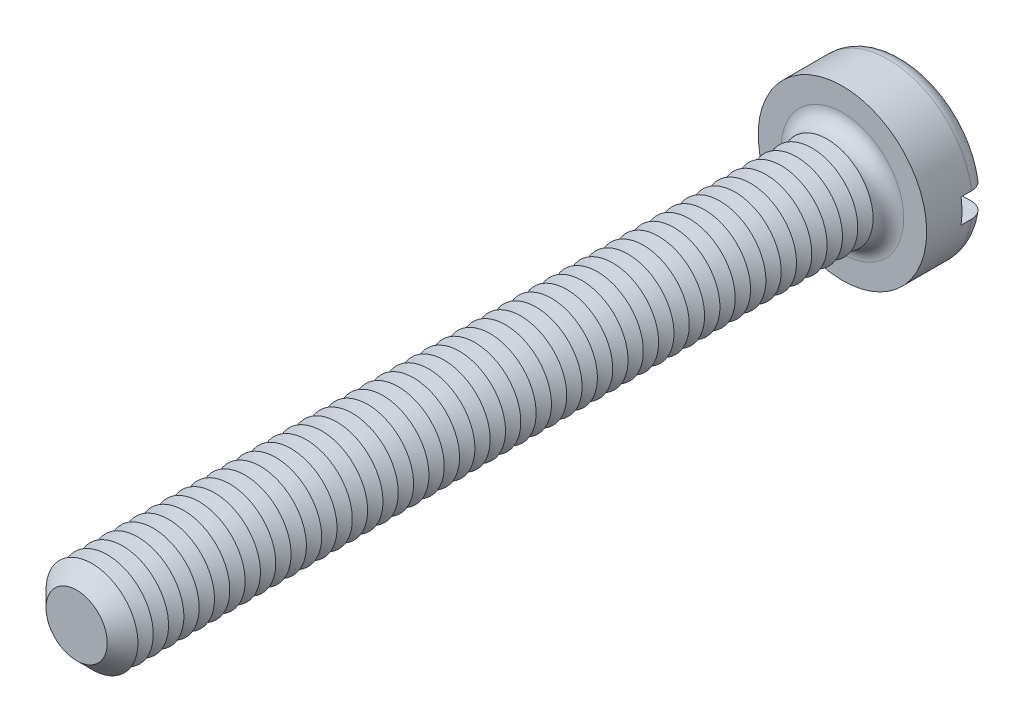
ISO-10303-21;
HEADER;
FILE_DESCRIPTION(('STEP AP214'),'2;1');
FILE_NAME('part.step','',(''),(''),'','','');
FILE_SCHEMA(('AUTOMOTIVE_DESIGN { 1 0 10303 214 1 1 1 1 }'));
ENDSEC;
DATA;
#1=APPLICATION_CONTEXT('core data for automotive mechanical design processes');
#2=APPLICATION_PROTOCOL_DEFINITION('international standard','automotive_design',2000,#1);
#3=PRODUCT_CONTEXT('',#1,'mechanical');
#4=PRODUCT('Part','Part','',(#3));
#5=PRODUCT_RELATED_PRODUCT_CATEGORY('part','',(#4));
#6=PRODUCT_DEFINITION_FORMATION('','',#4);
#7=PRODUCT_DEFINITION_CONTEXT('part definition',#1,'design');
#8=PRODUCT_DEFINITION('design','',#6,#7);
#9=PRODUCT_DEFINITION_SHAPE('','',#8);
#10=(LENGTH_UNIT() NAMED_UNIT(*) SI_UNIT(.MILLI.,.METRE.));
#11=(NAMED_UNIT(*) PLANE_ANGLE_UNIT() SI_UNIT($,.RADIAN.));
#12=(NAMED_UNIT(*) SI_UNIT($,.STERADIAN.) SOLID_ANGLE_UNIT());
#13=UNCERTAINTY_MEASURE_WITH_UNIT(LENGTH_MEASURE(1.E-05),#10,'distance_accuracy_value','');
#14=(GEOMETRIC_REPRESENTATION_CONTEXT(3) GLOBAL_UNCERTAINTY_ASSIGNED_CONTEXT((#13)) GLOBAL_UNIT_ASSIGNED_CONTEXT((#10,
#11,#12)) REPRESENTATION_CONTEXT('',''));
#15=CARTESIAN_POINT('',(0.,0.,0.));
#16=DIRECTION('',(0.,0.,1.));
#17=DIRECTION('',(1.,0.,0.));
#18=AXIS2_PLACEMENT_3D('',#15,#16,#17);
#19=CARTESIAN_POINT('',(0.,0.,-2.));
#20=DIRECTION('',(0.,0.,1.));
#21=DIRECTION('',(1.,0.,0.));
#22=AXIS2_PLACEMENT_3D('',#19,#20,#21);
#23=PLANE('',#22);
#24=CARTESIAN_POINT('',(0.,0.,-2.));
#25=DIRECTION('',(0.,0.,1.));
#26=DIRECTION('',(1.,0.,0.));
#27=AXIS2_PLACEMENT_3D('',#24,#25,#26);
#28=CIRCLE('',#27,2.25);
#29=CARTESIAN_POINT('',(-2.21415898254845,0.4,-2.));
#30=VERTEX_POINT('',#29);
#31=CARTESIAN_POINT('',(2.21415898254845,0.4,-2.));
#32=VERTEX_POINT('',#31);
#33=EDGE_CURVE('E116',#30,#32,#28,.F.);
#34=ORIENTED_EDGE('',*,*,#33,.T.);
#35=DIRECTION('',(1.,0.,0.));
#36=VECTOR('',#35,1.);
#37=CARTESIAN_POINT('',(-2.75,0.400000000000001,-2.));
#38=LINE('',#37,#36);
#39=EDGE_CURVE('E111',#30,#32,#38,.T.);
#40=ORIENTED_EDGE('',*,*,#39,.F.);
#41=EDGE_LOOP('',(#34,#40));
#42=FACE_BOUND('',#41,.T.);
#43=ADVANCED_FACE('F39',(#42),#23,.F.);
#44=CARTESIAN_POINT('',(0.,0.,-1.5));
#45=DIRECTION('',(0.,0.,1.));
#46=DIRECTION('',(1.,0.,0.));
#47=AXIS2_PLACEMENT_3D('',#44,#45,#46);
#48=TOROIDAL_SURFACE('',#47,2.25,0.5);
#49=CARTESIAN_POINT('',(-2.6296588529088,0.400000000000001,-1.78631483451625));
#50=CARTESIAN_POINT('',(-2.61332846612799,0.400000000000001,-1.80942627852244));
#51=CARTESIAN_POINT('',(-2.59501593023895,0.400000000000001,-1.83116426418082));
#52=CARTESIAN_POINT('',(-2.55497423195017,0.400000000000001,-1.87126271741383));
#53=CARTESIAN_POINT('',(-2.53324055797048,0.4,-1.88961865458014));
#54=CARTESIAN_POINT('',(-2.48702796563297,0.4,-1.92241505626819));
#55=CARTESIAN_POINT('',(-2.46255183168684,0.4,-1.93685944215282));
#56=CARTESIAN_POINT('',(-2.41154731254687,0.4,-1.96147315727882));
#57=CARTESIAN_POINT('',(-2.38501943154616,0.4,-1.97164353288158));
#58=CARTESIAN_POINT('',(-2.3303912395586,0.4,-1.98753780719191));
#59=CARTESIAN_POINT('',(-2.30227842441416,0.4,-1.99321871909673));
#60=CARTESIAN_POINT('',(-2.24549884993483,0.4,-1.99984170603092));
#61=CARTESIAN_POINT('',(-2.21683202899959,0.4,-2.00078325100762));
#62=CARTESIAN_POINT('',(-2.15939326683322,0.4,-1.99790249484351));
#63=CARTESIAN_POINT('',(-2.13062419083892,0.4,-1.99402290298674));
#64=CARTESIAN_POINT('',(-2.07413526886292,0.4,-1.98151915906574));
#65=CARTESIAN_POINT('',(-2.04641547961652,0.4,-1.97289475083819));
#66=CARTESIAN_POINT('',(-1.99264697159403,0.4,-1.95107177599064));
#67=CARTESIAN_POINT('',(-1.96660904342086,0.4,-1.93784659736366));
#68=CARTESIAN_POINT('',(-1.91713954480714,0.4,-1.90718730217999));
#69=CARTESIAN_POINT('',(-1.89370795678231,0.4,-1.88975321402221));
#70=CARTESIAN_POINT('',(-1.85029144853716,0.4,-1.85126548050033));
#71=CARTESIAN_POINT('',(-1.83028607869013,0.4,-1.83023492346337));
#72=CARTESIAN_POINT('',(-1.79417432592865,0.4,-1.78505552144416));
#73=CARTESIAN_POINT('',(-1.77806752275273,0.4,-1.76090701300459));
#74=CARTESIAN_POINT('',(-1.75056079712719,0.4,-1.71067721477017));
#75=CARTESIAN_POINT('',(-1.7390748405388,0.4,-1.68464306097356));
#76=CARTESIAN_POINT('',(-1.72075680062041,0.4,-1.63098625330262));
#77=CARTESIAN_POINT('',(-1.71392397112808,0.4,-1.60336385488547));
#78=CARTESIAN_POINT('',(-1.70525661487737,0.4,-1.54801066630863));
#79=CARTESIAN_POINT('',(-1.70330866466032,0.4,-1.52029759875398));
#80=CARTESIAN_POINT('',(-1.70414820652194,0.4,-1.46494458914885));
#81=CARTESIAN_POINT('',(-1.70693532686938,0.4,-1.43730464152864));
#82=CARTESIAN_POINT('',(-1.71709335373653,0.4,-1.38318389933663));
#83=CARTESIAN_POINT('',(-1.72441580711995,0.4,-1.35669397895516));
#84=CARTESIAN_POINT('',(-1.74335830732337,0.4,-1.30529964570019));
#85=CARTESIAN_POINT('',(-1.75497853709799,0.4,-1.2803953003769));
#86=CARTESIAN_POINT('',(-1.78229453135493,0.4,-1.23258298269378));
#87=CARTESIAN_POINT('',(-1.79803217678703,0.4,-1.20969896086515));
#88=CARTESIAN_POINT('',(-1.83304498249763,0.4,-1.16682064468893));
#89=CARTESIAN_POINT('',(-1.85232054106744,0.4,-1.1468266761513));
#90=CARTESIAN_POINT('',(-1.89433695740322,0.4,-1.10980713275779));
#91=CARTESIAN_POINT('',(-1.91714740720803,0.4,-1.09286053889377));
#92=CARTESIAN_POINT('',(-1.96524407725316,0.4,-1.06294809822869));
#93=CARTESIAN_POINT('',(-1.99053056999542,0.4,-1.04998269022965));
#94=CARTESIAN_POINT('',(-2.04340612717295,0.4,-1.02814800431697));
#95=CARTESIAN_POINT('',(-2.07103098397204,0.4,-1.01936532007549));
#96=CARTESIAN_POINT('',(-2.12735840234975,0.4,-1.00652373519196));
#97=CARTESIAN_POINT('',(-2.15606102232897,0.4,-1.00246509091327));
#98=CARTESIAN_POINT('',(-2.21395379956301,0.4,-0.999181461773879));
#99=CARTESIAN_POINT('',(-2.24314598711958,0.4,-0.999992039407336));
#100=CARTESIAN_POINT('',(-2.30097585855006,0.4,-1.00652779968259));
#101=CARTESIAN_POINT('',(-2.32961355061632,0.4,-1.01225290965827));
#102=CARTESIAN_POINT('',(-2.38536238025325,0.4,-1.02843951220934));
#103=CARTESIAN_POINT('',(-2.41248047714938,0.4,-1.03887701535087));
#104=CARTESIAN_POINT('',(-2.46454860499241,0.4,-1.06421009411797));
#105=CARTESIAN_POINT('',(-2.48949875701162,0.4,-1.0791054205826));
#106=CARTESIAN_POINT('',(-2.53620471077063,0.4,-1.11274531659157));
#107=CARTESIAN_POINT('',(-2.55799482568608,0.400000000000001,-1.1314422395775));
#108=CARTESIAN_POINT('',(-2.59807595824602,0.400000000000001,-1.17227176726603));
#109=CARTESIAN_POINT('',(-2.6163672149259,0.400000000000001,-1.19440413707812));
#110=CARTESIAN_POINT('',(-2.64868581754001,0.400000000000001,-1.24117072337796));
#111=CARTESIAN_POINT('',(-2.66276466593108,0.400000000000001,-1.26576935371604));
#112=CARTESIAN_POINT('',(-2.68654482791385,0.400000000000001,-1.31699754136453));
#113=CARTESIAN_POINT('',(-2.69624657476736,0.400000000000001,-1.34362689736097));
#114=CARTESIAN_POINT('',(-2.71090527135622,0.400000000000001,-1.39787706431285));
#115=CARTESIAN_POINT('',(-2.71590826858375,0.400000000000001,-1.4254854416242));
#116=CARTESIAN_POINT('',(-2.72118463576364,0.400000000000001,-1.48115803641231));
#117=CARTESIAN_POINT('',(-2.72145696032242,0.400000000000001,-1.50922235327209));
#118=CARTESIAN_POINT('',(-2.71727180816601,0.400000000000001,-1.56487271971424));
#119=CARTESIAN_POINT('',(-2.71283440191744,0.400000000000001,-1.59246029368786));
#120=CARTESIAN_POINT('',(-2.69939521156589,0.400000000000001,-1.64647499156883));
#121=CARTESIAN_POINT('',(-2.69039909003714,0.400000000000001,-1.67290351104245));
#122=CARTESIAN_POINT('',(-2.67251693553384,0.400000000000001,-1.71382731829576));
#123=CARTESIAN_POINT('',(-2.66497994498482,0.400000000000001,-1.72892686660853));
#124=CARTESIAN_POINT('',(-2.64841616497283,0.400000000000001,-1.75828509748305));
#125=CARTESIAN_POINT('',(-2.63938938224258,0.400000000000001,-1.77254378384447));
#126=CARTESIAN_POINT('',(-2.6296588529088,0.400000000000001,-1.78631483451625));
#127=B_SPLINE_CURVE_WITH_KNOTS('',3,(#49,#50,#51,#52,#53,#54,#55,#56,#57,#58,#59,#60,#61,#62,
#63,#64,#65,#66,#67,#68,#69,#70,#71,#72,#73,#74,#75,#76,#77,#78,#79,#80,#81,#82,#83,#84,#85,#86,
#87,#88,#89,#90,#91,#92,#93,#94,#95,#96,#97,#98,#99,#100,#101,#102,#103,#104,#105,#106,#107,
#108,#109,#110,#111,#112,#113,#114,#115,#116,#117,#118,#119,#120,#121,#122,#123,#124,#125,#126),
.UNSPECIFIED.,.T.,.F.,(4,2,2,2,2,2,2,2,2,2,2,2,2,2,2,2,2,2,2,2,2,2,2,2,2,2,2,2,2,2,2,2,2,2,2,2,
2,2,4),(0.,0.0848338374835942,0.16978050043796,0.254641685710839,0.339482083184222,
0.42512530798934,0.510778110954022,0.597458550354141,0.684143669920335,0.771338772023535,
0.858533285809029,0.945187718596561,1.03183280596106,1.11678035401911,1.20171427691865,
1.28465703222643,1.36759327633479,1.4496584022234,1.53172702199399,1.61466526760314,
1.69761285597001,1.78247103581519,1.86733856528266,1.95389396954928,2.0404540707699,
2.12764713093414,2.21483890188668,2.30159172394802,2.38833969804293,2.4740609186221,
2.55977628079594,2.6443962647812,2.72900787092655,2.81278135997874,2.89657336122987,
2.98000971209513,3.06334267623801,3.113891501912,3.16444009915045),.UNSPECIFIED.);
#128=CARTESIAN_POINT('',(-2.72075357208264,0.400000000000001,-1.50000000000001));
#129=VERTEX_POINT('',#128);
#130=EDGE_CURVE('E563',#129,#30,#127,.T.);
#131=ORIENTED_EDGE('',*,*,#130,.F.);
#132=CARTESIAN_POINT('',(0.,0.,-1.5));
#133=DIRECTION('',(0.,0.,1.));
#134=DIRECTION('',(1.,0.,0.));
#135=AXIS2_PLACEMENT_3D('',#132,#133,#134);
#136=CIRCLE('',#135,2.75);
#137=CARTESIAN_POINT('',(2.7207535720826,0.4,-1.5));
#138=VERTEX_POINT('',#137);
#139=EDGE_CURVE('E125',#138,#129,#136,.T.);
#140=ORIENTED_EDGE('',*,*,#139,.F.);
#141=CARTESIAN_POINT('',(1.7362507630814,0.4,-1.6752840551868));
#142=CARTESIAN_POINT('',(1.74636083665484,0.4,-1.70159961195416));
#143=CARTESIAN_POINT('',(1.7587429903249,0.4,-1.72706707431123));
#144=CARTESIAN_POINT('',(1.78764414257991,0.4,-1.77556609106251));
#145=CARTESIAN_POINT('',(1.80416918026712,0.4,-1.79859401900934));
#146=CARTESIAN_POINT('',(1.84080454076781,0.4,-1.84153587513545));
#147=CARTESIAN_POINT('',(1.86090949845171,0.4,-1.86145438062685));
#148=CARTESIAN_POINT('',(1.9041208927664,0.4,-1.89769607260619));
#149=CARTESIAN_POINT('',(1.92722659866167,0.4,-1.91402013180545));
#150=CARTESIAN_POINT('',(1.97620958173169,0.4,-1.94291288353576));
#151=CARTESIAN_POINT('',(2.00212726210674,0.4,-1.95541309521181));
#152=CARTESIAN_POINT('',(2.05567603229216,0.4,-1.97595143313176));
#153=CARTESIAN_POINT('',(2.08330733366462,0.4,-1.98398900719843));
#154=CARTESIAN_POINT('',(2.13989163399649,0.4,-1.99545904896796));
#155=CARTESIAN_POINT('',(2.16885726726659,0.4,-1.99882930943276));
#156=CARTESIAN_POINT('',(2.22694412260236,0.4,-2.00065872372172));
#157=CARTESIAN_POINT('',(2.25606534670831,0.4,-1.99911781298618));
#158=CARTESIAN_POINT('',(2.31362436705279,0.4,-1.99114818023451));
#159=CARTESIAN_POINT('',(2.34206235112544,0.4,-1.98472081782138));
#160=CARTESIAN_POINT('',(2.39743709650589,0.4,-1.96713601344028));
#161=CARTESIAN_POINT('',(2.42437392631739,0.4,-1.95597878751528));
#162=CARTESIAN_POINT('',(2.47569769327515,0.4,-1.92935960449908));
#163=CARTESIAN_POINT('',(2.50010686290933,0.4,-1.91394052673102));
#164=CARTESIAN_POINT('',(2.54594525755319,0.4,-1.8791725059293));
#165=CARTESIAN_POINT('',(2.56737468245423,0.4,-1.85982382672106));
#166=CARTESIAN_POINT('',(2.60634898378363,0.4,-1.81801641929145));
#167=CARTESIAN_POINT('',(2.6239407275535,0.4,-1.79560138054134));
#168=CARTESIAN_POINT('',(2.65505953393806,0.4,-1.7481077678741));
#169=CARTESIAN_POINT('',(2.66858686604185,0.4,-1.72302937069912));
#170=CARTESIAN_POINT('',(2.69103536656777,0.4,-1.67123055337));
#171=CARTESIAN_POINT('',(2.70000740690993,0.4,-1.64453217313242));
#172=CARTESIAN_POINT('',(2.71330608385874,0.4,-1.59000262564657));
#173=CARTESIAN_POINT('',(2.71763293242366,0.4,-1.5621715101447));
#174=CARTESIAN_POINT('',(2.72149675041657,0.4,-1.50637655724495));
#175=CARTESIAN_POINT('',(2.72106725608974,0.4,-1.47841503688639));
#176=CARTESIAN_POINT('',(2.7155123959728,0.4,-1.42296287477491));
#177=CARTESIAN_POINT('',(2.71038711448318,0.4,-1.39547222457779));
#178=CARTESIAN_POINT('',(2.69560462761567,0.4,-1.34178071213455));
#179=CARTESIAN_POINT('',(2.68595389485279,0.4,-1.31557806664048));
#180=CARTESIAN_POINT('',(2.66240876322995,0.4,-1.26515516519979));
#181=CARTESIAN_POINT('',(2.64851431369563,0.4,-1.24093493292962));
#182=CARTESIAN_POINT('',(2.61681930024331,0.4,-1.19504594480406));
#183=CARTESIAN_POINT('',(2.59900198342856,0.4,-1.17338876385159));
#184=CARTESIAN_POINT('',(2.56001495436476,0.4,-1.13333899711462));
#185=CARTESIAN_POINT('',(2.53884510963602,0.4,-1.11494654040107));
#186=CARTESIAN_POINT('',(2.49354554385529,0.4,-1.08175888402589));
#187=CARTESIAN_POINT('',(2.46938991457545,0.4,-1.06699905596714));
#188=CARTESIAN_POINT('',(2.41896725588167,0.4,-1.04168682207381));
#189=CARTESIAN_POINT('',(2.39270009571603,0.4,-1.03113467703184));
#190=CARTESIAN_POINT('',(2.33844927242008,0.4,-1.01439607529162));
#191=CARTESIAN_POINT('',(2.31044823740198,0.4,-1.00826592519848));
#192=CARTESIAN_POINT('',(2.25381752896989,0.4,-1.00073183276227));
#193=CARTESIAN_POINT('',(2.22518781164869,0.4,-0.999328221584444));
#194=CARTESIAN_POINT('',(2.16774231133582,0.4,-1.00127811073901));
#195=CARTESIAN_POINT('',(2.13892848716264,0.4,-1.00468955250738));
#196=CARTESIAN_POINT('',(2.08227193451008,0.4,-1.01626887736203));
#197=CARTESIAN_POINT('',(2.05442926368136,0.4,-1.02443704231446));
#198=CARTESIAN_POINT('',(2.00032604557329,0.4,-1.04537295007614));
#199=CARTESIAN_POINT('',(1.97407661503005,0.4,-1.05816944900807));
#200=CARTESIAN_POINT('',(1.92411255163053,0.4,-1.08801035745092));
#201=CARTESIAN_POINT('',(1.90039792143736,0.4,-1.10505477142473));
#202=CARTESIAN_POINT('',(1.85633574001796,0.4,-1.14282887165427));
#203=CARTESIAN_POINT('',(1.83597040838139,0.4,-1.16353779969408));
#204=CARTESIAN_POINT('',(1.79908731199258,0.4,-1.20813793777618));
#205=CARTESIAN_POINT('',(1.78256899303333,0.4,-1.23202868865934));
#206=CARTESIAN_POINT('',(1.75420022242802,0.4,-1.28183173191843));
#207=CARTESIAN_POINT('',(1.74226635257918,0.4,-1.30769648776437));
#208=CARTESIAN_POINT('',(1.72302798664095,0.4,-1.36110211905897));
#209=CARTESIAN_POINT('',(1.71572395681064,0.4,-1.38864316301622));
#210=CARTESIAN_POINT('',(1.70611974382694,0.4,-1.44392326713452));
#211=CARTESIAN_POINT('',(1.70370764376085,0.4,-1.47164298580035));
#212=CARTESIAN_POINT('',(1.70363822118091,0.4,-1.52706336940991));
#213=CARTESIAN_POINT('',(1.70597448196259,0.4,-1.55476400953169));
#214=CARTESIAN_POINT('',(1.71335146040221,0.4,-1.59796127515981));
#215=CARTESIAN_POINT('',(1.71686033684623,0.4,-1.61373520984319));
#216=CARTESIAN_POINT('',(1.7254146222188,0.4,-1.64486018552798));
#217=CARTESIAN_POINT('',(1.73045999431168,0.4,-1.66021123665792));
#218=CARTESIAN_POINT('',(1.7362507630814,0.4,-1.6752840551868));
#219=B_SPLINE_CURVE_WITH_KNOTS('',3,(#141,#142,#143,#144,#145,#146,#147,#148,#149,#150,#151,
#152,#153,#154,#155,#156,#157,#158,#159,#160,#161,#162,#163,#164,#165,#166,#167,#168,#169,#170,
#171,#172,#173,#174,#175,#176,#177,#178,#179,#180,#181,#182,#183,#184,#185,#186,#187,#188,#189,
#190,#191,#192,#193,#194,#195,#196,#197,#198,#199,#200,#201,#202,#203,#204,#205,#206,#207,#208,
#209,#210,#211,#212,#213,#214,#215,#216,#217,#218),.UNSPECIFIED.,.T.,.F.,(4,2,2,2,2,2,2,2,2,2,2,
2,2,2,2,2,2,2,2,2,2,2,2,2,2,2,2,2,2,2,2,2,2,2,2,2,2,2,4),(0.,0.0845117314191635,
0.169147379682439,0.253657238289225,0.338146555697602,0.424070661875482,0.510005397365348,
0.597074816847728,0.684145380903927,0.771191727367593,0.858234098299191,0.94443074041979,
1.03062159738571,1.11569223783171,1.20075723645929,1.28485012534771,1.36893917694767,
1.45243570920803,1.53593074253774,1.61930671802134,1.70268368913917,1.7864238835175,
1.87016738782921,1.95469664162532,2.03923113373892,2.12482389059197,2.21042264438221,
2.29706026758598,2.38370302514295,2.47089361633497,2.55808429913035,2.64479602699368,
2.73149525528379,2.81653234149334,2.9015779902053,2.98465497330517,3.06761976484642,
3.11602689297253,3.164432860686),.UNSPECIFIED.);
#220=EDGE_CURVE('E565',#32,#138,#219,.T.);
#221=ORIENTED_EDGE('',*,*,#220,.F.);
#222=ORIENTED_EDGE('',*,*,#33,.F.);
#223=EDGE_LOOP('',(#131,#140,#221,#222));
#224=FACE_BOUND('',#223,.T.);
#225=ADVANCED_FACE('F547',(#224),#48,.T.);
#226=CARTESIAN_POINT('',(0.,0.,-2.));
#227=DIRECTION('',(0.,0.,1.));
#228=DIRECTION('',(1.,0.,0.));
#229=AXIS2_PLACEMENT_3D('',#226,#227,#228);
#230=CYLINDRICAL_SURFACE('',#229,2.75);
#231=DIRECTION('',(0.,0.,1.));
#232=VECTOR('',#231,1.);
#233=CARTESIAN_POINT('',(2.72075357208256,0.4,-2.));
#234=LINE('',#233,#232);
#235=CARTESIAN_POINT('',(2.72075357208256,0.4,-1.15));
#236=VERTEX_POINT('',#235);
#237=EDGE_CURVE('E578',#138,#236,#234,.T.);
#238=ORIENTED_EDGE('',*,*,#237,.F.);
#239=ORIENTED_EDGE('',*,*,#139,.T.);
#240=DIRECTION('',(0.,0.,1.));
#241=VECTOR('',#240,1.);
#242=CARTESIAN_POINT('',(-2.72075357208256,0.4,-2.));
#243=LINE('',#242,#241);
#244=CARTESIAN_POINT('',(-2.72075357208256,0.4,-1.15));
#245=VERTEX_POINT('',#244);
#246=EDGE_CURVE('E63',#245,#129,#243,.F.);
#247=ORIENTED_EDGE('',*,*,#246,.F.);
#248=CARTESIAN_POINT('',(0.,0.,-1.15));
#249=DIRECTION('',(0.,0.,-1.));
#250=DIRECTION('',(-1.,0.,0.));
#251=AXIS2_PLACEMENT_3D('',#248,#249,#250);
#252=CIRCLE('',#251,2.75);
#253=CARTESIAN_POINT('',(-2.72075357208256,-0.4,-1.15));
#254=VERTEX_POINT('',#253);
#255=EDGE_CURVE('E43',#245,#254,#252,.F.);
#256=ORIENTED_EDGE('',*,*,#255,.T.);
#257=DIRECTION('',(0.,0.,1.));
#258=VECTOR('',#257,1.);
#259=CARTESIAN_POINT('',(-2.72075357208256,-0.4,-2.));
#260=LINE('',#259,#258);
#261=CARTESIAN_POINT('',(-2.72075357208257,-0.4,-1.5));
#262=VERTEX_POINT('',#261);
#263=EDGE_CURVE('E575',#262,#254,#260,.T.);
#264=ORIENTED_EDGE('',*,*,#263,.F.);
#265=CARTESIAN_POINT('',(2.72075357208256,-0.4,-1.5));
#266=VERTEX_POINT('',#265);
#267=EDGE_CURVE('E127',#262,#266,#136,.T.);
#268=ORIENTED_EDGE('',*,*,#267,.T.);
#269=DIRECTION('',(0.,0.,1.));
#270=VECTOR('',#269,1.);
#271=CARTESIAN_POINT('',(2.72075357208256,-0.4,-2.));
#272=LINE('',#271,#270);
#273=CARTESIAN_POINT('',(2.72075357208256,-0.4,-1.15));
#274=VERTEX_POINT('',#273);
#275=EDGE_CURVE('E55',#274,#266,#272,.F.);
#276=ORIENTED_EDGE('',*,*,#275,.F.);
#277=EDGE_CURVE('E11',#274,#236,#252,.F.);
#278=ORIENTED_EDGE('',*,*,#277,.T.);
#279=EDGE_LOOP('',(#238,#239,#247,#256,#264,#268,#276,#278));
#280=FACE_BOUND('',#279,.T.);
#281=CARTESIAN_POINT('',(0.,0.,0.));
#282=DIRECTION('',(0.,0.,1.));
#283=DIRECTION('',(1.,0.,0.));
#284=AXIS2_PLACEMENT_3D('',#281,#282,#283);
#285=CIRCLE('',#284,2.75);
#286=CARTESIAN_POINT('',(2.75,0.,0.));
#287=VERTEX_POINT('',#286);
#288=EDGE_CURVE('E581',#287,#287,#285,.T.);
#289=ORIENTED_EDGE('',*,*,#288,.F.);
#290=EDGE_LOOP('',(#289));
#291=FACE_BOUND('',#290,.T.);
#292=ADVANCED_FACE('F543',(#280,#291),#230,.T.);
#293=CARTESIAN_POINT('',(2.21415898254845,-0.4,-2.));
#294=VERTEX_POINT('',#293);
#295=CARTESIAN_POINT('',(-2.21415898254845,-0.4,-2.));
#296=VERTEX_POINT('',#295);
#297=EDGE_CURVE('E109',#294,#296,#28,.F.);
#298=ORIENTED_EDGE('',*,*,#297,.T.);
#299=DIRECTION('',(-1.,0.,0.));
#300=VECTOR('',#299,1.);
#301=CARTESIAN_POINT('',(-2.75,-0.4,-2.));
#302=LINE('',#301,#300);
#303=EDGE_CURVE('E96',#294,#296,#302,.T.);
#304=ORIENTED_EDGE('',*,*,#303,.F.);
#305=EDGE_LOOP('',(#298,#304));
#306=FACE_BOUND('',#305,.T.);
#307=ADVANCED_FACE('F108',(#306),#23,.F.);
#308=CARTESIAN_POINT('',(0.,0.,0.));
#309=DIRECTION('',(0.,0.,1.));
#310=DIRECTION('',(1.,0.,0.));
#311=AXIS2_PLACEMENT_3D('',#308,#309,#310);
#312=PLANE('',#311);
#313=CARTESIAN_POINT('',(0.,0.,0.));
#314=DIRECTION('',(0.,0.,1.));
#315=DIRECTION('',(1.,0.,0.));
#316=AXIS2_PLACEMENT_3D('',#313,#314,#315);
#317=CIRCLE('',#316,2.);
#318=CARTESIAN_POINT('',(2.,0.,0.));
#319=VERTEX_POINT('',#318);
#320=EDGE_CURVE('E115',#319,#319,#317,.F.);
#321=ORIENTED_EDGE('',*,*,#320,.T.);
#322=EDGE_LOOP('',(#321));
#323=FACE_BOUND('',#322,.T.);
#324=ORIENTED_EDGE('',*,*,#288,.T.);
#325=EDGE_LOOP('',(#324));
#326=FACE_BOUND('',#325,.T.);
#327=ADVANCED_FACE('F542',(#323,#326),#312,.T.);
#328=CARTESIAN_POINT('',(-2.6296588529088,-0.4,-1.78631483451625));
#329=CARTESIAN_POINT('',(-2.64575286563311,-0.4,-1.76353353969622));
#330=CARTESIAN_POINT('',(-2.65994473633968,-0.4,-1.73938506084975));
#331=CARTESIAN_POINT('',(-2.68408879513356,-0.4,-1.68903091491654));
#332=CARTESIAN_POINT('',(-2.69403633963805,-0.4,-1.6628230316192));
#333=CARTESIAN_POINT('',(-2.70937899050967,-0.4,-1.60911025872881));
#334=CARTESIAN_POINT('',(-2.71477511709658,-0.4,-1.5816056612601));
#335=CARTESIAN_POINT('',(-2.72085365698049,-0.4,-1.52608718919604));
#336=CARTESIAN_POINT('',(-2.7215371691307,-0.4,-1.49807343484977));
#337=CARTESIAN_POINT('',(-2.71817903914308,-0.4,-1.44242333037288));
#338=CARTESIAN_POINT('',(-2.71415291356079,-0.4,-1.41478604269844));
#339=CARTESIAN_POINT('',(-2.70152104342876,-0.4,-1.36057835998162));
#340=CARTESIAN_POINT('',(-2.69291517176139,-0.4,-1.33400799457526));
#341=CARTESIAN_POINT('',(-2.67137052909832,-0.4,-1.28266198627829));
#342=CARTESIAN_POINT('',(-2.65842829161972,-0.4,-1.25788779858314));
#343=CARTESIAN_POINT('',(-2.62859348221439,-0.4,-1.21084577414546));
#344=CARTESIAN_POINT('',(-2.61170082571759,-0.4,-1.18857799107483));
#345=CARTESIAN_POINT('',(-2.5743351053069,-0.4,-1.1470221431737));
#346=CARTESIAN_POINT('',(-2.55383974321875,-0.4,-1.12775413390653));
#347=CARTESIAN_POINT('',(-2.5099353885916,-0.4,-1.09288845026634));
#348=CARTESIAN_POINT('',(-2.48652625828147,-0.4,-1.07729094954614));
#349=CARTESIAN_POINT('',(-2.43718903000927,-0.4,-1.0500239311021));
#350=CARTESIAN_POINT('',(-2.41123629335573,-0.4,-1.0383990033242));
#351=CARTESIAN_POINT('',(-2.35776417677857,-0.4,-1.01960886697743));
#352=CARTESIAN_POINT('',(-2.33024469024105,-0.4,-1.01244396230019));
#353=CARTESIAN_POINT('',(-2.27404134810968,-0.4,-1.00268156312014));
#354=CARTESIAN_POINT('',(-2.24534705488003,-0.4,-1.00014414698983));
#355=CARTESIAN_POINT('',(-2.18793513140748,-0.4,-0.999867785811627));
#356=CARTESIAN_POINT('',(-2.15921749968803,-0.4,-1.00212917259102));
#357=CARTESIAN_POINT('',(-2.10225052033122,-0.4,-1.01142552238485));
#358=CARTESIAN_POINT('',(-2.07400941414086,-0.4,-1.01851105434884));
#359=CARTESIAN_POINT('',(-2.01911044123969,-0.4,-1.03730994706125));
#360=CARTESIAN_POINT('',(-1.99245264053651,-0.4,-1.04902350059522));
#361=CARTESIAN_POINT('',(-1.94142108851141,-0.4,-1.07679847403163));
#362=CARTESIAN_POINT('',(-1.91705303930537,-0.4,-1.09287038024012));
#363=CARTESIAN_POINT('',(-1.87139758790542,-0.4,-1.12891897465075));
#364=CARTESIAN_POINT('',(-1.85011007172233,-0.4,-1.14889551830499));
#365=CARTESIAN_POINT('',(-1.81149058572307,-0.4,-1.19196940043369));
#366=CARTESIAN_POINT('',(-1.79411779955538,-0.4,-1.21503011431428));
#367=CARTESIAN_POINT('',(-1.76359546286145,-0.4,-1.26379588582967));
#368=CARTESIAN_POINT('',(-1.75044532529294,-0.4,-1.28950057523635));
#369=CARTESIAN_POINT('',(-1.72906221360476,-0.4,-1.3422057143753));
#370=CARTESIAN_POINT('',(-1.72072512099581,-0.4,-1.3691639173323));
#371=CARTESIAN_POINT('',(-1.70880448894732,-0.4,-1.42411084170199));
#372=CARTESIAN_POINT('',(-1.7052202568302,-0.4,-1.45209941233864));
#373=CARTESIAN_POINT('',(-1.70295553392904,-0.4,-1.50768522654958));
#374=CARTESIAN_POINT('',(-1.70417398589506,-0.4,-1.53527840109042));
#375=CARTESIAN_POINT('',(-1.71124536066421,-0.4,-1.58986292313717));
#376=CARTESIAN_POINT('',(-1.71709811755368,-0.4,-1.61685429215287));
#377=CARTESIAN_POINT('',(-1.73321132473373,-0.4,-1.66938107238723));
#378=CARTESIAN_POINT('',(-1.74345625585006,-0.4,-1.69492125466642));
#379=CARTESIAN_POINT('',(-1.76802111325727,-0.4,-1.74395877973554));
#380=CARTESIAN_POINT('',(-1.78234133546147,-0.4,-1.76745597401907));
#381=CARTESIAN_POINT('',(-1.81488631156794,-0.4,-1.81216193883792));
#382=CARTESIAN_POINT('',(-1.83317116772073,-0.4,-1.83332693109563));
#383=CARTESIAN_POINT('',(-1.87296030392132,-0.4,-1.872375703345));
#384=CARTESIAN_POINT('',(-1.89446497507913,-0.4,-1.89025908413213));
#385=CARTESIAN_POINT('',(-1.94063077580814,-0.4,-1.92267732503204));
#386=CARTESIAN_POINT('',(-1.96535444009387,-0.4,-1.93712316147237));
#387=CARTESIAN_POINT('',(-2.01684705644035,-0.4,-1.96173690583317));
#388=CARTESIAN_POINT('',(-2.04361620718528,-0.4,-1.97190439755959));
#389=CARTESIAN_POINT('',(-2.09891021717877,-0.4,-1.9878230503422));
#390=CARTESIAN_POINT('',(-2.12745653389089,-0.4,-1.99349978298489));
#391=CARTESIAN_POINT('',(-2.18509639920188,-0.4,-1.99999556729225));
#392=CARTESIAN_POINT('',(-2.21418994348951,-0.4,-2.00081465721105));
#393=CARTESIAN_POINT('',(-2.27218032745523,-0.4,-1.99755156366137));
#394=CARTESIAN_POINT('',(-2.30107643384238,-0.4,-1.99345627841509));
#395=CARTESIAN_POINT('',(-2.35776697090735,-0.4,-1.98043125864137));
#396=CARTESIAN_POINT('',(-2.38556116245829,-0.4,-1.97150048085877));
#397=CARTESIAN_POINT('',(-2.43901832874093,-0.4,-1.94912081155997));
#398=CARTESIAN_POINT('',(-2.46469578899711,-0.4,-1.93570648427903));
#399=CARTESIAN_POINT('',(-2.51337022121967,-0.4,-1.90471183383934));
#400=CARTESIAN_POINT('',(-2.53637056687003,-0.4,-1.88713684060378));
#401=CARTESIAN_POINT('',(-2.57111030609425,-0.4,-1.85552084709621));
#402=CARTESIAN_POINT('',(-2.58386709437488,-0.4,-1.84257896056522));
#403=CARTESIAN_POINT('',(-2.60790410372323,-0.4,-1.81538935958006));
#404=CARTESIAN_POINT('',(-2.61918433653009,-0.4,-1.80114165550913));
#405=CARTESIAN_POINT('',(-2.6296588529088,-0.4,-1.78631483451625));
#406=B_SPLINE_CURVE_WITH_KNOTS('',3,(#328,#329,#330,#331,#332,#333,#334,#335,#336,#337,#338,
#339,#340,#341,#342,#343,#344,#345,#346,#347,#348,#349,#350,#351,#352,#353,#354,#355,#356,#357,
#358,#359,#360,#361,#362,#363,#364,#365,#366,#367,#368,#369,#370,#371,#372,#373,#374,#375,#376,
#377,#378,#379,#380,#381,#382,#383,#384,#385,#386,#387,#388,#389,#390,#391,#392,#393,#394,#395,
#396,#397,#398,#399,#400,#401,#402,#403,#404,#405),.UNSPECIFIED.,.T.,.F.,(4,2,2,2,2,2,2,2,2,2,2,
2,2,2,2,2,2,2,2,2,2,2,2,2,2,2,2,2,2,2,2,2,2,2,2,2,2,2,4),(0.,0.0836125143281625,
0.167316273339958,0.251001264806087,0.334666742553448,0.418057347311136,0.501450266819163,
0.584910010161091,0.668371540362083,0.752369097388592,0.836370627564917,0.921286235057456,
1.00620762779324,1.09222390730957,1.17824613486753,1.26518425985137,1.35212600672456,
1.43927882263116,1.52642841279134,1.61262232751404,1.69880425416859,1.7830443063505,
1.86727208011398,1.9497371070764,2.03219918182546,2.1143722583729,2.19655130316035,
2.28007615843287,2.36361116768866,2.44911836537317,2.53463387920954,2.62153862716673,
2.70844269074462,2.79557895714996,2.88273403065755,2.96923214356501,3.05562004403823,
3.11003826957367,3.16445606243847),.UNSPECIFIED.);
#407=EDGE_CURVE('E103',#296,#262,#406,.T.);
#408=ORIENTED_EDGE('',*,*,#407,.F.);
#409=ORIENTED_EDGE('',*,*,#297,.F.);
#410=CARTESIAN_POINT('',(1.7362507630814,-0.4,-1.6752840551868));
#411=CARTESIAN_POINT('',(1.72641416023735,-0.4,-1.64967314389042));
#412=CARTESIAN_POINT('',(1.71871480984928,-0.4,-1.62322216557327));
#413=CARTESIAN_POINT('',(1.70786038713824,-0.4,-1.56938399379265));
#414=CARTESIAN_POINT('',(1.70470970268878,-0.4,-1.54199592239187));
#415=CARTESIAN_POINT('',(1.70306971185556,-0.4,-1.48708393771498));
#416=CARTESIAN_POINT('',(1.70457942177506,-0.4,-1.45956005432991));
#417=CARTESIAN_POINT('',(1.71220670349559,-0.4,-1.40516538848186));
#418=CARTESIAN_POINT('',(1.71832341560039,-0.4,-1.3782944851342));
#419=CARTESIAN_POINT('',(1.73494792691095,-0.4,-1.32598312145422));
#420=CARTESIAN_POINT('',(1.74545076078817,-0.4,-1.30054108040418));
#421=CARTESIAN_POINT('',(1.77051013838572,-0.4,-1.25173932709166));
#422=CARTESIAN_POINT('',(1.7850670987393,-0.4,-1.22837982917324));
#423=CARTESIAN_POINT('',(1.81806903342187,-0.4,-1.1839775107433));
#424=CARTESIAN_POINT('',(1.8365752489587,-0.4,-1.16298023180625));
#425=CARTESIAN_POINT('',(1.87677669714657,-0.4,-1.1243010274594));
#426=CARTESIAN_POINT('',(1.89847230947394,-0.4,-1.10661949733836));
#427=CARTESIAN_POINT('',(1.94498854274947,-0.4,-1.07463966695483));
#428=CARTESIAN_POINT('',(1.96987078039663,-0.4,-1.06043095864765));
#429=CARTESIAN_POINT('',(2.02163980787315,-0.4,-1.0363161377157));
#430=CARTESIAN_POINT('',(2.04852678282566,-0.4,-1.02641042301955));
#431=CARTESIAN_POINT('',(2.10400319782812,-0.4,-1.01104128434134));
#432=CARTESIAN_POINT('',(2.13261287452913,-0.4,-1.00565079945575));
#433=CARTESIAN_POINT('',(2.19033179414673,-0.4,-0.999735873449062));
#434=CARTESIAN_POINT('',(2.2194410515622,-0.4,-0.999211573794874));
#435=CARTESIAN_POINT('',(2.27740442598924,-0.4,-1.00306591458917));
#436=CARTESIAN_POINT('',(2.30625777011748,-0.4,-1.00745623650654));
#437=CARTESIAN_POINT('',(2.36280530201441,-0.4,-1.02105937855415));
#438=CARTESIAN_POINT('',(2.39049952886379,-0.4,-1.03027203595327));
#439=CARTESIAN_POINT('',(2.44369359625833,-0.4,-1.05318710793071));
#440=CARTESIAN_POINT('',(2.46920965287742,-0.4,-1.0668518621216));
#441=CARTESIAN_POINT('',(2.51754507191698,-0.4,-1.09832423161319));
#442=CARTESIAN_POINT('',(2.54036461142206,-0.4,-1.11613157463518));
#443=CARTESIAN_POINT('',(2.58234752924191,-0.4,-1.15513986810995));
#444=CARTESIAN_POINT('',(2.601553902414,-0.4,-1.1762945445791));
#445=CARTESIAN_POINT('',(2.63609001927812,-0.4,-1.22156192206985));
#446=CARTESIAN_POINT('',(2.65142002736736,-0.4,-1.24567442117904));
#447=CARTESIAN_POINT('',(2.67757733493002,-0.4,-1.29585881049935));
#448=CARTESIAN_POINT('',(2.68845668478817,-0.4,-1.32190357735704));
#449=CARTESIAN_POINT('',(2.7056478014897,-0.4,-1.375459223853));
#450=CARTESIAN_POINT('',(2.71195980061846,-0.4,-1.40297002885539));
#451=CARTESIAN_POINT('',(2.71979288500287,-0.4,-1.45843707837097));
#452=CARTESIAN_POINT('',(2.72135241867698,-0.4,-1.48638789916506));
#453=CARTESIAN_POINT('',(2.71974298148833,-0.4,-1.54215266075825));
#454=CARTESIAN_POINT('',(2.71657412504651,-0.4,-1.56996660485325));
#455=CARTESIAN_POINT('',(2.70561779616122,-0.4,-1.62459191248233));
#456=CARTESIAN_POINT('',(2.69784258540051,-0.4,-1.65140573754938));
#457=CARTESIAN_POINT('',(2.6779146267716,-0.4,-1.70335337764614));
#458=CARTESIAN_POINT('',(2.66576185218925,-0.4,-1.72848718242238));
#459=CARTESIAN_POINT('',(2.63739107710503,-0.4,-1.77645196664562));
#460=CARTESIAN_POINT('',(2.62116029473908,-0.4,-1.79927538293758));
#461=CARTESIAN_POINT('',(2.58512700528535,-0.4,-1.84190182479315));
#462=CARTESIAN_POINT('',(2.56532438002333,-0.4,-1.86170475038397));
#463=CARTESIAN_POINT('',(2.522535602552,-0.4,-1.89791219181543));
#464=CARTESIAN_POINT('',(2.49952399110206,-0.4,-1.91428661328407));
#465=CARTESIAN_POINT('',(2.45110500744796,-0.4,-1.94299324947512));
#466=CARTESIAN_POINT('',(2.4256974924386,-0.4,-1.95532522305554));
#467=CARTESIAN_POINT('',(2.37288090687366,-0.4,-1.97575769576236));
#468=CARTESIAN_POINT('',(2.34545135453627,-0.4,-1.98380524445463));
#469=CARTESIAN_POINT('',(2.28963821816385,-0.4,-1.99524443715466));
#470=CARTESIAN_POINT('',(2.26125456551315,-0.4,-1.99863574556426));
#471=CARTESIAN_POINT('',(2.20395671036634,-0.4,-2.00070487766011));
#472=CARTESIAN_POINT('',(2.17504033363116,-0.4,-1.99932265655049));
#473=CARTESIAN_POINT('',(2.11784130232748,-0.4,-1.9917648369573));
#474=CARTESIAN_POINT('',(2.08955866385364,-0.4,-1.98558911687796));
#475=CARTESIAN_POINT('',(2.03419451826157,-0.4,-1.96854979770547));
#476=CARTESIAN_POINT('',(2.00712437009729,-0.4,-1.95764925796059));
#477=CARTESIAN_POINT('',(1.95519572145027,-0.4,-1.93144413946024));
#478=CARTESIAN_POINT('',(1.93033780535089,-0.4,-1.91613840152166));
#479=CARTESIAN_POINT('',(1.88362525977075,-0.4,-1.88157419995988));
#480=CARTESIAN_POINT('',(1.86176428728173,-0.4,-1.86232430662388));
#481=CARTESIAN_POINT('',(1.82167218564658,-0.4,-1.82038600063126));
#482=CARTESIAN_POINT('',(1.803436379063,-0.4,-1.7977020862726));
#483=CARTESIAN_POINT('',(1.77700088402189,-0.4,-1.7582526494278));
#484=CARTESIAN_POINT('',(1.7675549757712,-0.4,-1.74230781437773));
#485=CARTESIAN_POINT('',(1.75049861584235,-0.4,-1.70946415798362));
#486=CARTESIAN_POINT('',(1.7428881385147,-0.4,-1.69256534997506));
#487=CARTESIAN_POINT('',(1.7362507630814,-0.4,-1.6752840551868));
#488=B_SPLINE_CURVE_WITH_KNOTS('',3,(#410,#411,#412,#413,#414,#415,#416,#417,#418,#419,#420,
#421,#422,#423,#424,#425,#426,#427,#428,#429,#430,#431,#432,#433,#434,#435,#436,#437,#438,#439,
#440,#441,#442,#443,#444,#445,#446,#447,#448,#449,#450,#451,#452,#453,#454,#455,#456,#457,#458,
#459,#460,#461,#462,#463,#464,#465,#466,#467,#468,#469,#470,#471,#472,#473,#474,#475,#476,#477,
#478,#479,#480,#481,#482,#483,#484,#485,#486,#487),.UNSPECIFIED.,.T.,.F.,(4,2,2,2,2,2,2,2,2,2,2,
2,2,2,2,2,2,2,2,2,2,2,2,2,2,2,2,2,2,2,2,2,2,2,2,2,2,2,4),(0.,0.0822382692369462,
0.164555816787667,0.246855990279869,0.329140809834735,0.411332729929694,0.493533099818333,
0.577115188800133,0.660707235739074,0.746270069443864,0.831840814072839,0.918768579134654,
1.00569887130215,1.09283622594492,1.17997064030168,1.26638632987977,1.35279634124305,
1.43810213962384,1.52340211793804,1.60767384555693,1.69194128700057,1.77552515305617,
1.85910699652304,1.94246734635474,2.02582820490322,2.10945367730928,2.19308191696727,
2.2774160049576,2.36175512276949,2.4471137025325,2.53247843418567,2.61892083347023,
2.70536542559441,2.79249842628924,2.87965437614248,2.96662291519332,3.05347850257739,
3.10897061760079,3.16446195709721),.UNSPECIFIED.);
#489=EDGE_CURVE('E92',#266,#294,#488,.T.);
#490=ORIENTED_EDGE('',*,*,#489,.F.);
#491=ORIENTED_EDGE('',*,*,#267,.F.);
#492=EDGE_LOOP('',(#408,#409,#490,#491));
#493=FACE_BOUND('',#492,.T.);
#494=ADVANCED_FACE('F113',(#493),#48,.T.);
#495=CARTESIAN_POINT('',(0.,0.,0.5));
#496=DIRECTION('',(0.,0.,1.));
#497=DIRECTION('',(1.,0.,0.));
#498=AXIS2_PLACEMENT_3D('',#495,#496,#497);
#499=TOROIDAL_SURFACE('',#498,2.,0.5);
#500=ORIENTED_EDGE('',*,*,#320,.F.);
#501=EDGE_LOOP('',(#500));
#502=FACE_BOUND('',#501,.T.);
#503=CARTESIAN_POINT('',(0.,0.,0.5));
#504=DIRECTION('',(0.,0.,-1.));
#505=DIRECTION('',(-1.,0.,0.));
#506=AXIS2_PLACEMENT_3D('',#503,#504,#505);
#507=CIRCLE('',#506,1.5);
#508=CARTESIAN_POINT('',(-1.5,0.,0.5));
#509=VERTEX_POINT('',#508);
#510=EDGE_CURVE('E587',#509,#509,#507,.T.);
#511=ORIENTED_EDGE('',*,*,#510,.T.);
#512=EDGE_LOOP('',(#511));
#513=FACE_BOUND('',#512,.T.);
#514=ADVANCED_FACE('F535',(#502,#513),#499,.F.);
#515=CARTESIAN_POINT('',(0.,0.,0.750000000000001));
#516=DIRECTION('',(0.,0.,-1.));
#517=DIRECTION('',(-1.,0.,0.));
#518=AXIS2_PLACEMENT_3D('',#515,#516,#517);
#519=CONICAL_SURFACE('',#518,1.06698729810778,1.0471975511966);
#520=ORIENTED_EDGE('',*,*,#510,.F.);
#521=EDGE_LOOP('',(#520));
#522=FACE_BOUND('',#521,.T.);
#523=CARTESIAN_POINT('',(0.,0.,0.750000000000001));
#524=DIRECTION('',(0.,0.,-1.));
#525=DIRECTION('',(-1.,0.,0.));
#526=AXIS2_PLACEMENT_3D('',#523,#524,#525);
#527=CIRCLE('',#526,1.06698729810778);
#528=CARTESIAN_POINT('',(-1.06698729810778,0.,0.750000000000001));
#529=VERTEX_POINT('',#528);
#530=EDGE_CURVE('E593',#529,#529,#527,.T.);
#531=ORIENTED_EDGE('',*,*,#530,.T.);
#532=EDGE_LOOP('',(#531));
#533=FACE_BOUND('',#532,.T.);
#534=ADVANCED_FACE('F531',(#522,#533),#519,.T.);
#535=CARTESIAN_POINT('',(0.,0.,1.));
#536=DIRECTION('',(0.,0.,1.));
#537=DIRECTION('',(1.,0.,0.));
#538=AXIS2_PLACEMENT_3D('',#535,#536,#537);
#539=CONICAL_SURFACE('',#538,1.5,1.0471975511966);
#540=ORIENTED_EDGE('',*,*,#530,.F.);
#541=EDGE_LOOP('',(#540));
#542=FACE_BOUND('',#541,.T.);
#543=CARTESIAN_POINT('',(0.,0.,1.));
#544=DIRECTION('',(0.,0.,-1.));
#545=DIRECTION('',(-1.,0.,0.));
#546=AXIS2_PLACEMENT_3D('',#543,#544,#545);
#547=CIRCLE('',#546,1.5);
#548=CARTESIAN_POINT('',(-1.5,0.,1.));
#549=VERTEX_POINT('',#548);
#550=EDGE_CURVE('E599',#549,#549,#547,.T.);
#551=ORIENTED_EDGE('',*,*,#550,.T.);
#552=EDGE_LOOP('',(#551));
#553=FACE_BOUND('',#552,.T.);
#554=ADVANCED_FACE('F527',(#542,#553),#539,.T.);
#555=CARTESIAN_POINT('',(0.,0.,1.25));
#556=DIRECTION('',(0.,0.,-1.));
#557=DIRECTION('',(-1.,0.,0.));
#558=AXIS2_PLACEMENT_3D('',#555,#556,#557);
#559=CONICAL_SURFACE('',#558,1.06698729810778,1.0471975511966);
#560=ORIENTED_EDGE('',*,*,#550,.F.);
#561=EDGE_LOOP('',(#560));
#562=FACE_BOUND('',#561,.T.);
#563=CARTESIAN_POINT('',(0.,0.,1.25));
#564=DIRECTION('',(0.,0.,-1.));
#565=DIRECTION('',(-1.,0.,0.));
#566=AXIS2_PLACEMENT_3D('',#563,#564,#565);
#567=CIRCLE('',#566,1.06698729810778);
#568=CARTESIAN_POINT('',(-1.06698729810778,0.,1.25));
#569=VERTEX_POINT('',#568);
#570=EDGE_CURVE('E603',#569,#569,#567,.T.);
#571=ORIENTED_EDGE('',*,*,#570,.T.);
#572=EDGE_LOOP('',(#571));
#573=FACE_BOUND('',#572,.T.);
#574=ADVANCED_FACE('F523',(#562,#573),#559,.T.);
#575=CARTESIAN_POINT('',(0.,0.,1.5));
#576=DIRECTION('',(0.,0.,1.));
#577=DIRECTION('',(1.,0.,0.));
#578=AXIS2_PLACEMENT_3D('',#575,#576,#577);
#579=CONICAL_SURFACE('',#578,1.5,1.0471975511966);
#580=ORIENTED_EDGE('',*,*,#570,.F.);
#581=EDGE_LOOP('',(#580));
#582=FACE_BOUND('',#581,.T.);
#583=CARTESIAN_POINT('',(0.,0.,1.5));
#584=DIRECTION('',(0.,0.,-1.));
#585=DIRECTION('',(-1.,0.,0.));
#586=AXIS2_PLACEMENT_3D('',#583,#584,#585);
#587=CIRCLE('',#586,1.5);
#588=CARTESIAN_POINT('',(-1.5,0.,1.5));
#589=VERTEX_POINT('',#588);
#590=EDGE_CURVE('E607',#589,#589,#587,.T.);
#591=ORIENTED_EDGE('',*,*,#590,.T.);
#592=EDGE_LOOP('',(#591));
#593=FACE_BOUND('',#592,.T.);
#594=ADVANCED_FACE('F519',(#582,#593),#579,.T.);
#595=CARTESIAN_POINT('',(0.,0.,1.75));
#596=DIRECTION('',(0.,0.,-1.));
#597=DIRECTION('',(-1.,0.,0.));
#598=AXIS2_PLACEMENT_3D('',#595,#596,#597);
#599=CONICAL_SURFACE('',#598,1.06698729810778,1.0471975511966);
#600=ORIENTED_EDGE('',*,*,#590,.F.);
#601=EDGE_LOOP('',(#600));
#602=FACE_BOUND('',#601,.T.);
#603=CARTESIAN_POINT('',(0.,0.,1.75));
#604=DIRECTION('',(0.,0.,-1.));
#605=DIRECTION('',(-1.,0.,0.));
#606=AXIS2_PLACEMENT_3D('',#603,#604,#605);
#607=CIRCLE('',#606,1.06698729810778);
#608=CARTESIAN_POINT('',(-1.06698729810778,0.,1.75));
#609=VERTEX_POINT('',#608);
#610=EDGE_CURVE('E611',#609,#609,#607,.T.);
#611=ORIENTED_EDGE('',*,*,#610,.T.);
#612=EDGE_LOOP('',(#611));
#613=FACE_BOUND('',#612,.T.);
#614=ADVANCED_FACE('F515',(#602,#613),#599,.T.);
#615=CARTESIAN_POINT('',(0.,0.,2.));
#616=DIRECTION('',(0.,0.,1.));
#617=DIRECTION('',(1.,0.,0.));
#618=AXIS2_PLACEMENT_3D('',#615,#616,#617);
#619=CONICAL_SURFACE('',#618,1.5,1.0471975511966);
#620=ORIENTED_EDGE('',*,*,#610,.F.);
#621=EDGE_LOOP('',(#620));
#622=FACE_BOUND('',#621,.T.);
#623=CARTESIAN_POINT('',(0.,0.,2.));
#624=DIRECTION('',(0.,0.,-1.));
#625=DIRECTION('',(-1.,0.,0.));
#626=AXIS2_PLACEMENT_3D('',#623,#624,#625);
#627=CIRCLE('',#626,1.5);
#628=CARTESIAN_POINT('',(-1.5,0.,2.));
#629=VERTEX_POINT('',#628);
#630=EDGE_CURVE('E615',#629,#629,#627,.T.);
#631=ORIENTED_EDGE('',*,*,#630,.T.);
#632=EDGE_LOOP('',(#631));
#633=FACE_BOUND('',#632,.T.);
#634=ADVANCED_FACE('F511',(#622,#633),#619,.T.);
#635=CARTESIAN_POINT('',(0.,0.,2.25));
#636=DIRECTION('',(0.,0.,-1.));
#637=DIRECTION('',(-1.,0.,0.));
#638=AXIS2_PLACEMENT_3D('',#635,#636,#637);
#639=CONICAL_SURFACE('',#638,1.06698729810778,1.0471975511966);
#640=ORIENTED_EDGE('',*,*,#630,.F.);
#641=EDGE_LOOP('',(#640));
#642=FACE_BOUND('',#641,.T.);
#643=CARTESIAN_POINT('',(0.,0.,2.25));
#644=DIRECTION('',(0.,0.,-1.));
#645=DIRECTION('',(-1.,0.,0.));
#646=AXIS2_PLACEMENT_3D('',#643,#644,#645);
#647=CIRCLE('',#646,1.06698729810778);
#648=CARTESIAN_POINT('',(-1.06698729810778,0.,2.25));
#649=VERTEX_POINT('',#648);
#650=EDGE_CURVE('E619',#649,#649,#647,.T.);
#651=ORIENTED_EDGE('',*,*,#650,.T.);
#652=EDGE_LOOP('',(#651));
#653=FACE_BOUND('',#652,.T.);
#654=ADVANCED_FACE('F507',(#642,#653),#639,.T.);
#655=CARTESIAN_POINT('',(0.,0.,2.5));
#656=DIRECTION('',(0.,0.,1.));
#657=DIRECTION('',(1.,0.,0.));
#658=AXIS2_PLACEMENT_3D('',#655,#656,#657);
#659=CONICAL_SURFACE('',#658,1.5,1.0471975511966);
#660=ORIENTED_EDGE('',*,*,#650,.F.);
#661=EDGE_LOOP('',(#660));
#662=FACE_BOUND('',#661,.T.);
#663=CARTESIAN_POINT('',(0.,0.,2.5));
#664=DIRECTION('',(0.,0.,-1.));
#665=DIRECTION('',(-1.,0.,0.));
#666=AXIS2_PLACEMENT_3D('',#663,#664,#665);
#667=CIRCLE('',#666,1.5);
#668=CARTESIAN_POINT('',(-1.5,0.,2.5));
#669=VERTEX_POINT('',#668);
#670=EDGE_CURVE('E623',#669,#669,#667,.T.);
#671=ORIENTED_EDGE('',*,*,#670,.T.);
#672=EDGE_LOOP('',(#671));
#673=FACE_BOUND('',#672,.T.);
#674=ADVANCED_FACE('F503',(#662,#673),#659,.T.);
#675=CARTESIAN_POINT('',(0.,0.,2.75));
#676=DIRECTION('',(0.,0.,-1.));
#677=DIRECTION('',(-1.,0.,0.));
#678=AXIS2_PLACEMENT_3D('',#675,#676,#677);
#679=CONICAL_SURFACE('',#678,1.06698729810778,1.0471975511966);
#680=ORIENTED_EDGE('',*,*,#670,.F.);
#681=EDGE_LOOP('',(#680));
#682=FACE_BOUND('',#681,.T.);
#683=CARTESIAN_POINT('',(0.,0.,2.75));
#684=DIRECTION('',(0.,0.,-1.));
#685=DIRECTION('',(-1.,0.,0.));
#686=AXIS2_PLACEMENT_3D('',#683,#684,#685);
#687=CIRCLE('',#686,1.06698729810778);
#688=CARTESIAN_POINT('',(-1.06698729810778,0.,2.75));
#689=VERTEX_POINT('',#688);
#690=EDGE_CURVE('E626',#689,#689,#687,.T.);
#691=ORIENTED_EDGE('',*,*,#690,.T.);
#692=EDGE_LOOP('',(#691));
#693=FACE_BOUND('',#692,.T.);
#694=ADVANCED_FACE('F499',(#682,#693),#679,.T.);
#695=CARTESIAN_POINT('',(0.,0.,3.));
#696=DIRECTION('',(0.,0.,1.));
#697=DIRECTION('',(1.,0.,0.));
#698=AXIS2_PLACEMENT_3D('',#695,#696,#697);
#699=CONICAL_SURFACE('',#698,1.5,1.0471975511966);
#700=ORIENTED_EDGE('',*,*,#690,.F.);
#701=EDGE_LOOP('',(#700));
#702=FACE_BOUND('',#701,.T.);
#703=CARTESIAN_POINT('',(0.,0.,3.));
#704=DIRECTION('',(0.,0.,-1.));
#705=DIRECTION('',(-1.,0.,0.));
#706=AXIS2_PLACEMENT_3D('',#703,#704,#705);
#707=CIRCLE('',#706,1.5);
#708=CARTESIAN_POINT('',(-1.5,0.,3.));
#709=VERTEX_POINT('',#708);
#710=EDGE_CURVE('E630',#709,#709,#707,.T.);
#711=ORIENTED_EDGE('',*,*,#710,.T.);
#712=EDGE_LOOP('',(#711));
#713=FACE_BOUND('',#712,.T.);
#714=ADVANCED_FACE('F495',(#702,#713),#699,.T.);
#715=CARTESIAN_POINT('',(0.,0.,3.25));
#716=DIRECTION('',(0.,0.,-1.));
#717=DIRECTION('',(-1.,0.,0.));
#718=AXIS2_PLACEMENT_3D('',#715,#716,#717);
#719=CONICAL_SURFACE('',#718,1.06698729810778,1.0471975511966);
#720=ORIENTED_EDGE('',*,*,#710,.F.);
#721=EDGE_LOOP('',(#720));
#722=FACE_BOUND('',#721,.T.);
#723=CARTESIAN_POINT('',(0.,0.,3.25));
#724=DIRECTION('',(0.,0.,-1.));
#725=DIRECTION('',(-1.,0.,0.));
#726=AXIS2_PLACEMENT_3D('',#723,#724,#725);
#727=CIRCLE('',#726,1.06698729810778);
#728=CARTESIAN_POINT('',(-1.06698729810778,0.,3.25));
#729=VERTEX_POINT('',#728);
#730=EDGE_CURVE('E634',#729,#729,#727,.T.);
#731=ORIENTED_EDGE('',*,*,#730,.T.);
#732=EDGE_LOOP('',(#731));
#733=FACE_BOUND('',#732,.T.);
#734=ADVANCED_FACE('F491',(#722,#733),#719,.T.);
#735=CARTESIAN_POINT('',(0.,0.,3.5));
#736=DIRECTION('',(0.,0.,1.));
#737=DIRECTION('',(1.,0.,0.));
#738=AXIS2_PLACEMENT_3D('',#735,#736,#737);
#739=CONICAL_SURFACE('',#738,1.5,1.0471975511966);
#740=ORIENTED_EDGE('',*,*,#730,.F.);
#741=EDGE_LOOP('',(#740));
#742=FACE_BOUND('',#741,.T.);
#743=CARTESIAN_POINT('',(0.,0.,3.5));
#744=DIRECTION('',(0.,0.,-1.));
#745=DIRECTION('',(-1.,0.,0.));
#746=AXIS2_PLACEMENT_3D('',#743,#744,#745);
#747=CIRCLE('',#746,1.5);
#748=CARTESIAN_POINT('',(-1.5,0.,3.5));
#749=VERTEX_POINT('',#748);
#750=EDGE_CURVE('E638',#749,#749,#747,.T.);
#751=ORIENTED_EDGE('',*,*,#750,.T.);
#752=EDGE_LOOP('',(#751));
#753=FACE_BOUND('',#752,.T.);
#754=ADVANCED_FACE('F487',(#742,#753),#739,.T.);
#755=CARTESIAN_POINT('',(0.,0.,3.75));
#756=DIRECTION('',(0.,0.,-1.));
#757=DIRECTION('',(-1.,0.,0.));
#758=AXIS2_PLACEMENT_3D('',#755,#756,#757);
#759=CONICAL_SURFACE('',#758,1.06698729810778,1.0471975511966);
#760=ORIENTED_EDGE('',*,*,#750,.F.);
#761=EDGE_LOOP('',(#760));
#762=FACE_BOUND('',#761,.T.);
#763=CARTESIAN_POINT('',(0.,0.,3.75));
#764=DIRECTION('',(0.,0.,-1.));
#765=DIRECTION('',(-1.,0.,0.));
#766=AXIS2_PLACEMENT_3D('',#763,#764,#765);
#767=CIRCLE('',#766,1.06698729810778);
#768=CARTESIAN_POINT('',(-1.06698729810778,0.,3.75));
#769=VERTEX_POINT('',#768);
#770=EDGE_CURVE('E642',#769,#769,#767,.T.);
#771=ORIENTED_EDGE('',*,*,#770,.T.);
#772=EDGE_LOOP('',(#771));
#773=FACE_BOUND('',#772,.T.);
#774=ADVANCED_FACE('F483',(#762,#773),#759,.T.);
#775=CARTESIAN_POINT('',(0.,0.,4.));
#776=DIRECTION('',(0.,0.,1.));
#777=DIRECTION('',(1.,0.,0.));
#778=AXIS2_PLACEMENT_3D('',#775,#776,#777);
#779=CONICAL_SURFACE('',#778,1.5,1.0471975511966);
#780=ORIENTED_EDGE('',*,*,#770,.F.);
#781=EDGE_LOOP('',(#780));
#782=FACE_BOUND('',#781,.T.);
#783=CARTESIAN_POINT('',(0.,0.,4.));
#784=DIRECTION('',(0.,0.,-1.));
#785=DIRECTION('',(-1.,0.,0.));
#786=AXIS2_PLACEMENT_3D('',#783,#784,#785);
#787=CIRCLE('',#786,1.5);
#788=CARTESIAN_POINT('',(-1.5,0.,4.));
#789=VERTEX_POINT('',#788);
#790=EDGE_CURVE('E646',#789,#789,#787,.T.);
#791=ORIENTED_EDGE('',*,*,#790,.T.);
#792=EDGE_LOOP('',(#791));
#793=FACE_BOUND('',#792,.T.);
#794=ADVANCED_FACE('F479',(#782,#793),#779,.T.);
#795=CARTESIAN_POINT('',(0.,0.,4.25));
#796=DIRECTION('',(0.,0.,-1.));
#797=DIRECTION('',(-1.,0.,0.));
#798=AXIS2_PLACEMENT_3D('',#795,#796,#797);
#799=CONICAL_SURFACE('',#798,1.06698729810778,1.0471975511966);
#800=ORIENTED_EDGE('',*,*,#790,.F.);
#801=EDGE_LOOP('',(#800));
#802=FACE_BOUND('',#801,.T.);
#803=CARTESIAN_POINT('',(0.,0.,4.25));
#804=DIRECTION('',(0.,0.,-1.));
#805=DIRECTION('',(-1.,0.,0.));
#806=AXIS2_PLACEMENT_3D('',#803,#804,#805);
#807=CIRCLE('',#806,1.06698729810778);
#808=CARTESIAN_POINT('',(-1.06698729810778,0.,4.25));
#809=VERTEX_POINT('',#808);
#810=EDGE_CURVE('E649',#809,#809,#807,.T.);
#811=ORIENTED_EDGE('',*,*,#810,.T.);
#812=EDGE_LOOP('',(#811));
#813=FACE_BOUND('',#812,.T.);
#814=ADVANCED_FACE('F475',(#802,#813),#799,.T.);
#815=CARTESIAN_POINT('',(0.,0.,4.5));
#816=DIRECTION('',(0.,0.,1.));
#817=DIRECTION('',(1.,0.,0.));
#818=AXIS2_PLACEMENT_3D('',#815,#816,#817);
#819=CONICAL_SURFACE('',#818,1.5,1.0471975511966);
#820=ORIENTED_EDGE('',*,*,#810,.F.);
#821=EDGE_LOOP('',(#820));
#822=FACE_BOUND('',#821,.T.);
#823=CARTESIAN_POINT('',(0.,0.,4.5));
#824=DIRECTION('',(0.,0.,-1.));
#825=DIRECTION('',(-1.,0.,0.));
#826=AXIS2_PLACEMENT_3D('',#823,#824,#825);
#827=CIRCLE('',#826,1.5);
#828=CARTESIAN_POINT('',(-1.5,0.,4.5));
#829=VERTEX_POINT('',#828);
#830=EDGE_CURVE('E653',#829,#829,#827,.T.);
#831=ORIENTED_EDGE('',*,*,#830,.T.);
#832=EDGE_LOOP('',(#831));
#833=FACE_BOUND('',#832,.T.);
#834=ADVANCED_FACE('F471',(#822,#833),#819,.T.);
#835=CARTESIAN_POINT('',(0.,0.,4.75));
#836=DIRECTION('',(0.,0.,-1.));
#837=DIRECTION('',(-1.,0.,0.));
#838=AXIS2_PLACEMENT_3D('',#835,#836,#837);
#839=CONICAL_SURFACE('',#838,1.06698729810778,1.0471975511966);
#840=ORIENTED_EDGE('',*,*,#830,.F.);
#841=EDGE_LOOP('',(#840));
#842=FACE_BOUND('',#841,.T.);
#843=CARTESIAN_POINT('',(0.,0.,4.75));
#844=DIRECTION('',(0.,0.,-1.));
#845=DIRECTION('',(-1.,0.,0.));
#846=AXIS2_PLACEMENT_3D('',#843,#844,#845);
#847=CIRCLE('',#846,1.06698729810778);
#848=CARTESIAN_POINT('',(-1.06698729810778,0.,4.75));
#849=VERTEX_POINT('',#848);
#850=EDGE_CURVE('E657',#849,#849,#847,.T.);
#851=ORIENTED_EDGE('',*,*,#850,.T.);
#852=EDGE_LOOP('',(#851));
#853=FACE_BOUND('',#852,.T.);
#854=ADVANCED_FACE('F467',(#842,#853),#839,.T.);
#855=CARTESIAN_POINT('',(0.,0.,5.));
#856=DIRECTION('',(0.,0.,1.));
#857=DIRECTION('',(1.,0.,0.));
#858=AXIS2_PLACEMENT_3D('',#855,#856,#857);
#859=CONICAL_SURFACE('',#858,1.5,1.0471975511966);
#860=ORIENTED_EDGE('',*,*,#850,.F.);
#861=EDGE_LOOP('',(#860));
#862=FACE_BOUND('',#861,.T.);
#863=CARTESIAN_POINT('',(0.,0.,5.));
#864=DIRECTION('',(0.,0.,-1.));
#865=DIRECTION('',(-1.,0.,0.));
#866=AXIS2_PLACEMENT_3D('',#863,#864,#865);
#867=CIRCLE('',#866,1.5);
#868=CARTESIAN_POINT('',(-1.5,0.,5.));
#869=VERTEX_POINT('',#868);
#870=EDGE_CURVE('E661',#869,#869,#867,.T.);
#871=ORIENTED_EDGE('',*,*,#870,.T.);
#872=EDGE_LOOP('',(#871));
#873=FACE_BOUND('',#872,.T.);
#874=ADVANCED_FACE('F463',(#862,#873),#859,.T.);
#875=CARTESIAN_POINT('',(0.,0.,5.25));
#876=DIRECTION('',(0.,0.,-1.));
#877=DIRECTION('',(-1.,0.,0.));
#878=AXIS2_PLACEMENT_3D('',#875,#876,#877);
#879=CONICAL_SURFACE('',#878,1.06698729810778,1.0471975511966);
#880=ORIENTED_EDGE('',*,*,#870,.F.);
#881=EDGE_LOOP('',(#880));
#882=FACE_BOUND('',#881,.T.);
#883=CARTESIAN_POINT('',(0.,0.,5.25));
#884=DIRECTION('',(0.,0.,-1.));
#885=DIRECTION('',(-1.,0.,0.));
#886=AXIS2_PLACEMENT_3D('',#883,#884,#885);
#887=CIRCLE('',#886,1.06698729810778);
#888=CARTESIAN_POINT('',(-1.06698729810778,0.,5.25));
#889=VERTEX_POINT('',#888);
#890=EDGE_CURVE('E665',#889,#889,#887,.T.);
#891=ORIENTED_EDGE('',*,*,#890,.T.);
#892=EDGE_LOOP('',(#891));
#893=FACE_BOUND('',#892,.T.);
#894=ADVANCED_FACE('F459',(#882,#893),#879,.T.);
#895=CARTESIAN_POINT('',(0.,0.,5.5));
#896=DIRECTION('',(0.,0.,1.));
#897=DIRECTION('',(1.,0.,0.));
#898=AXIS2_PLACEMENT_3D('',#895,#896,#897);
#899=CONICAL_SURFACE('',#898,1.5,1.0471975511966);
#900=ORIENTED_EDGE('',*,*,#890,.F.);
#901=EDGE_LOOP('',(#900));
#902=FACE_BOUND('',#901,.T.);
#903=CARTESIAN_POINT('',(0.,0.,5.5));
#904=DIRECTION('',(0.,0.,-1.));
#905=DIRECTION('',(-1.,0.,0.));
#906=AXIS2_PLACEMENT_3D('',#903,#904,#905);
#907=CIRCLE('',#906,1.5);
#908=CARTESIAN_POINT('',(-1.5,0.,5.5));
#909=VERTEX_POINT('',#908);
#910=EDGE_CURVE('E669',#909,#909,#907,.T.);
#911=ORIENTED_EDGE('',*,*,#910,.T.);
#912=EDGE_LOOP('',(#911));
#913=FACE_BOUND('',#912,.T.);
#914=ADVANCED_FACE('F455',(#902,#913),#899,.T.);
#915=CARTESIAN_POINT('',(0.,0.,5.75));
#916=DIRECTION('',(0.,0.,-1.));
#917=DIRECTION('',(-1.,0.,0.));
#918=AXIS2_PLACEMENT_3D('',#915,#916,#917);
#919=CONICAL_SURFACE('',#918,1.06698729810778,1.0471975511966);
#920=ORIENTED_EDGE('',*,*,#910,.F.);
#921=EDGE_LOOP('',(#920));
#922=FACE_BOUND('',#921,.T.);
#923=CARTESIAN_POINT('',(0.,0.,5.75));
#924=DIRECTION('',(0.,0.,-1.));
#925=DIRECTION('',(-1.,0.,0.));
#926=AXIS2_PLACEMENT_3D('',#923,#924,#925);
#927=CIRCLE('',#926,1.06698729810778);
#928=CARTESIAN_POINT('',(-1.06698729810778,0.,5.75));
#929=VERTEX_POINT('',#928);
#930=EDGE_CURVE('E673',#929,#929,#927,.T.);
#931=ORIENTED_EDGE('',*,*,#930,.T.);
#932=EDGE_LOOP('',(#931));
#933=FACE_BOUND('',#932,.T.);
#934=ADVANCED_FACE('F451',(#922,#933),#919,.T.);
#935=CARTESIAN_POINT('',(0.,0.,6.));
#936=DIRECTION('',(0.,0.,1.));
#937=DIRECTION('',(1.,0.,0.));
#938=AXIS2_PLACEMENT_3D('',#935,#936,#937);
#939=CONICAL_SURFACE('',#938,1.5,1.0471975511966);
#940=ORIENTED_EDGE('',*,*,#930,.F.);
#941=EDGE_LOOP('',(#940));
#942=FACE_BOUND('',#941,.T.);
#943=CARTESIAN_POINT('',(0.,0.,6.));
#944=DIRECTION('',(0.,0.,-1.));
#945=DIRECTION('',(-1.,0.,0.));
#946=AXIS2_PLACEMENT_3D('',#943,#944,#945);
#947=CIRCLE('',#946,1.5);
#948=CARTESIAN_POINT('',(-1.5,0.,6.));
#949=VERTEX_POINT('',#948);
#950=EDGE_CURVE('E676',#949,#949,#947,.T.);
#951=ORIENTED_EDGE('',*,*,#950,.T.);
#952=EDGE_LOOP('',(#951));
#953=FACE_BOUND('',#952,.T.);
#954=ADVANCED_FACE('F447',(#942,#953),#939,.T.);
#955=CARTESIAN_POINT('',(0.,0.,6.25));
#956=DIRECTION('',(0.,0.,-1.));
#957=DIRECTION('',(-1.,0.,0.));
#958=AXIS2_PLACEMENT_3D('',#955,#956,#957);
#959=CONICAL_SURFACE('',#958,1.06698729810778,1.0471975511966);
#960=ORIENTED_EDGE('',*,*,#950,.F.);
#961=EDGE_LOOP('',(#960));
#962=FACE_BOUND('',#961,.T.);
#963=CARTESIAN_POINT('',(0.,0.,6.25));
#964=DIRECTION('',(0.,0.,-1.));
#965=DIRECTION('',(-1.,0.,0.));
#966=AXIS2_PLACEMENT_3D('',#963,#964,#965);
#967=CIRCLE('',#966,1.06698729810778);
#968=CARTESIAN_POINT('',(-1.06698729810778,0.,6.25));
#969=VERTEX_POINT('',#968);
#970=EDGE_CURVE('E679',#969,#969,#967,.T.);
#971=ORIENTED_EDGE('',*,*,#970,.T.);
#972=EDGE_LOOP('',(#971));
#973=FACE_BOUND('',#972,.T.);
#974=ADVANCED_FACE('F443',(#962,#973),#959,.T.);
#975=CARTESIAN_POINT('',(0.,0.,6.5));
#976=DIRECTION('',(0.,0.,1.));
#977=DIRECTION('',(1.,0.,0.));
#978=AXIS2_PLACEMENT_3D('',#975,#976,#977);
#979=CONICAL_SURFACE('',#978,1.5,1.0471975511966);
#980=ORIENTED_EDGE('',*,*,#970,.F.);
#981=EDGE_LOOP('',(#980));
#982=FACE_BOUND('',#981,.T.);
#983=CARTESIAN_POINT('',(0.,0.,6.5));
#984=DIRECTION('',(0.,0.,-1.));
#985=DIRECTION('',(-1.,0.,0.));
#986=AXIS2_PLACEMENT_3D('',#983,#984,#985);
#987=CIRCLE('',#986,1.5);
#988=CARTESIAN_POINT('',(-1.5,0.,6.5));
#989=VERTEX_POINT('',#988);
#990=EDGE_CURVE('E683',#989,#989,#987,.T.);
#991=ORIENTED_EDGE('',*,*,#990,.T.);
#992=EDGE_LOOP('',(#991));
#993=FACE_BOUND('',#992,.T.);
#994=ADVANCED_FACE('F439',(#982,#993),#979,.T.);
#995=CARTESIAN_POINT('',(0.,0.,6.75));
#996=DIRECTION('',(0.,0.,-1.));
#997=DIRECTION('',(-1.,0.,0.));
#998=AXIS2_PLACEMENT_3D('',#995,#996,#997);
#999=CONICAL_SURFACE('',#998,1.06698729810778,1.0471975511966);
#1000=ORIENTED_EDGE('',*,*,#990,.F.);
#1001=EDGE_LOOP('',(#1000));
#1002=FACE_BOUND('',#1001,.T.);
#1003=CARTESIAN_POINT('',(0.,0.,6.75));
#1004=DIRECTION('',(0.,0.,-1.));
#1005=DIRECTION('',(-1.,0.,0.));
#1006=AXIS2_PLACEMENT_3D('',#1003,#1004,#1005);
#1007=CIRCLE('',#1006,1.06698729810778);
#1008=CARTESIAN_POINT('',(-1.06698729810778,0.,6.75));
#1009=VERTEX_POINT('',#1008);
#1010=EDGE_CURVE('E687',#1009,#1009,#1007,.T.);
#1011=ORIENTED_EDGE('',*,*,#1010,.T.);
#1012=EDGE_LOOP('',(#1011));
#1013=FACE_BOUND('',#1012,.T.);
#1014=ADVANCED_FACE('F435',(#1002,#1013),#999,.T.);
#1015=CARTESIAN_POINT('',(0.,0.,7.));
#1016=DIRECTION('',(0.,0.,1.));
#1017=DIRECTION('',(1.,0.,0.));
#1018=AXIS2_PLACEMENT_3D('',#1015,#1016,#1017);
#1019=CONICAL_SURFACE('',#1018,1.5,1.0471975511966);
#1020=ORIENTED_EDGE('',*,*,#1010,.F.);
#1021=EDGE_LOOP('',(#1020));
#1022=FACE_BOUND('',#1021,.T.);
#1023=CARTESIAN_POINT('',(0.,0.,7.));
#1024=DIRECTION('',(0.,0.,-1.));
#1025=DIRECTION('',(-1.,0.,0.));
#1026=AXIS2_PLACEMENT_3D('',#1023,#1024,#1025);
#1027=CIRCLE('',#1026,1.5);
#1028=CARTESIAN_POINT('',(-1.5,0.,7.));
#1029=VERTEX_POINT('',#1028);
#1030=EDGE_CURVE('E691',#1029,#1029,#1027,.T.);
#1031=ORIENTED_EDGE('',*,*,#1030,.T.);
#1032=EDGE_LOOP('',(#1031));
#1033=FACE_BOUND('',#1032,.T.);
#1034=ADVANCED_FACE('F431',(#1022,#1033),#1019,.T.);
#1035=CARTESIAN_POINT('',(0.,0.,7.25));
#1036=DIRECTION('',(0.,0.,-1.));
#1037=DIRECTION('',(-1.,0.,0.));
#1038=AXIS2_PLACEMENT_3D('',#1035,#1036,#1037);
#1039=CONICAL_SURFACE('',#1038,1.06698729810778,1.0471975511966);
#1040=ORIENTED_EDGE('',*,*,#1030,.F.);
#1041=EDGE_LOOP('',(#1040));
#1042=FACE_BOUND('',#1041,.T.);
#1043=CARTESIAN_POINT('',(0.,0.,7.25));
#1044=DIRECTION('',(0.,0.,-1.));
#1045=DIRECTION('',(-1.,0.,0.));
#1046=AXIS2_PLACEMENT_3D('',#1043,#1044,#1045);
#1047=CIRCLE('',#1046,1.06698729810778);
#1048=CARTESIAN_POINT('',(-1.06698729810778,0.,7.25));
#1049=VERTEX_POINT('',#1048);
#1050=EDGE_CURVE('E695',#1049,#1049,#1047,.T.);
#1051=ORIENTED_EDGE('',*,*,#1050,.T.);
#1052=EDGE_LOOP('',(#1051));
#1053=FACE_BOUND('',#1052,.T.);
#1054=ADVANCED_FACE('F427',(#1042,#1053),#1039,.T.);
#1055=CARTESIAN_POINT('',(0.,0.,7.5));
#1056=DIRECTION('',(0.,0.,1.));
#1057=DIRECTION('',(1.,0.,0.));
#1058=AXIS2_PLACEMENT_3D('',#1055,#1056,#1057);
#1059=CONICAL_SURFACE('',#1058,1.5,1.0471975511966);
#1060=ORIENTED_EDGE('',*,*,#1050,.F.);
#1061=EDGE_LOOP('',(#1060));
#1062=FACE_BOUND('',#1061,.T.);
#1063=CARTESIAN_POINT('',(0.,0.,7.5));
#1064=DIRECTION('',(0.,0.,-1.));
#1065=DIRECTION('',(-1.,0.,0.));
#1066=AXIS2_PLACEMENT_3D('',#1063,#1064,#1065);
#1067=CIRCLE('',#1066,1.5);
#1068=CARTESIAN_POINT('',(-1.5,0.,7.5));
#1069=VERTEX_POINT('',#1068);
#1070=EDGE_CURVE('E699',#1069,#1069,#1067,.T.);
#1071=ORIENTED_EDGE('',*,*,#1070,.T.);
#1072=EDGE_LOOP('',(#1071));
#1073=FACE_BOUND('',#1072,.T.);
#1074=ADVANCED_FACE('F423',(#1062,#1073),#1059,.T.);
#1075=CARTESIAN_POINT('',(0.,0.,7.75));
#1076=DIRECTION('',(0.,0.,-1.));
#1077=DIRECTION('',(-1.,0.,0.));
#1078=AXIS2_PLACEMENT_3D('',#1075,#1076,#1077);
#1079=CONICAL_SURFACE('',#1078,1.06698729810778,1.0471975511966);
#1080=ORIENTED_EDGE('',*,*,#1070,.F.);
#1081=EDGE_LOOP('',(#1080));
#1082=FACE_BOUND('',#1081,.T.);
#1083=CARTESIAN_POINT('',(0.,0.,7.75));
#1084=DIRECTION('',(0.,0.,-1.));
#1085=DIRECTION('',(-1.,0.,0.));
#1086=AXIS2_PLACEMENT_3D('',#1083,#1084,#1085);
#1087=CIRCLE('',#1086,1.06698729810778);
#1088=CARTESIAN_POINT('',(-1.06698729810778,0.,7.75));
#1089=VERTEX_POINT('',#1088);
#1090=EDGE_CURVE('E703',#1089,#1089,#1087,.T.);
#1091=ORIENTED_EDGE('',*,*,#1090,.T.);
#1092=EDGE_LOOP('',(#1091));
#1093=FACE_BOUND('',#1092,.T.);
#1094=ADVANCED_FACE('F419',(#1082,#1093),#1079,.T.);
#1095=CARTESIAN_POINT('',(0.,0.,8.));
#1096=DIRECTION('',(0.,0.,1.));
#1097=DIRECTION('',(1.,0.,0.));
#1098=AXIS2_PLACEMENT_3D('',#1095,#1096,#1097);
#1099=CONICAL_SURFACE('',#1098,1.5,1.0471975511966);
#1100=ORIENTED_EDGE('',*,*,#1090,.F.);
#1101=EDGE_LOOP('',(#1100));
#1102=FACE_BOUND('',#1101,.T.);
#1103=CARTESIAN_POINT('',(0.,0.,8.));
#1104=DIRECTION('',(0.,0.,-1.));
#1105=DIRECTION('',(-1.,0.,0.));
#1106=AXIS2_PLACEMENT_3D('',#1103,#1104,#1105);
#1107=CIRCLE('',#1106,1.5);
#1108=CARTESIAN_POINT('',(-1.5,0.,8.));
#1109=VERTEX_POINT('',#1108);
#1110=EDGE_CURVE('E707',#1109,#1109,#1107,.T.);
#1111=ORIENTED_EDGE('',*,*,#1110,.T.);
#1112=EDGE_LOOP('',(#1111));
#1113=FACE_BOUND('',#1112,.T.);
#1114=ADVANCED_FACE('F415',(#1102,#1113),#1099,.T.);
#1115=CARTESIAN_POINT('',(0.,0.,8.25));
#1116=DIRECTION('',(0.,0.,-1.));
#1117=DIRECTION('',(-1.,0.,0.));
#1118=AXIS2_PLACEMENT_3D('',#1115,#1116,#1117);
#1119=CONICAL_SURFACE('',#1118,1.06698729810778,1.0471975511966);
#1120=ORIENTED_EDGE('',*,*,#1110,.F.);
#1121=EDGE_LOOP('',(#1120));
#1122=FACE_BOUND('',#1121,.T.);
#1123=CARTESIAN_POINT('',(0.,0.,8.25));
#1124=DIRECTION('',(0.,0.,-1.));
#1125=DIRECTION('',(-1.,0.,0.));
#1126=AXIS2_PLACEMENT_3D('',#1123,#1124,#1125);
#1127=CIRCLE('',#1126,1.06698729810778);
#1128=CARTESIAN_POINT('',(-1.06698729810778,0.,8.25));
#1129=VERTEX_POINT('',#1128);
#1130=EDGE_CURVE('E711',#1129,#1129,#1127,.T.);
#1131=ORIENTED_EDGE('',*,*,#1130,.T.);
#1132=EDGE_LOOP('',(#1131));
#1133=FACE_BOUND('',#1132,.T.);
#1134=ADVANCED_FACE('F411',(#1122,#1133),#1119,.T.);
#1135=CARTESIAN_POINT('',(0.,0.,8.5));
#1136=DIRECTION('',(0.,0.,1.));
#1137=DIRECTION('',(1.,0.,0.));
#1138=AXIS2_PLACEMENT_3D('',#1135,#1136,#1137);
#1139=CONICAL_SURFACE('',#1138,1.5,1.0471975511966);
#1140=ORIENTED_EDGE('',*,*,#1130,.F.);
#1141=EDGE_LOOP('',(#1140));
#1142=FACE_BOUND('',#1141,.T.);
#1143=CARTESIAN_POINT('',(0.,0.,8.5));
#1144=DIRECTION('',(0.,0.,-1.));
#1145=DIRECTION('',(-1.,0.,0.));
#1146=AXIS2_PLACEMENT_3D('',#1143,#1144,#1145);
#1147=CIRCLE('',#1146,1.5);
#1148=CARTESIAN_POINT('',(-1.5,0.,8.5));
#1149=VERTEX_POINT('',#1148);
#1150=EDGE_CURVE('E715',#1149,#1149,#1147,.T.);
#1151=ORIENTED_EDGE('',*,*,#1150,.T.);
#1152=EDGE_LOOP('',(#1151));
#1153=FACE_BOUND('',#1152,.T.);
#1154=ADVANCED_FACE('F407',(#1142,#1153),#1139,.T.);
#1155=CARTESIAN_POINT('',(0.,0.,8.75));
#1156=DIRECTION('',(0.,0.,-1.));
#1157=DIRECTION('',(-1.,0.,0.));
#1158=AXIS2_PLACEMENT_3D('',#1155,#1156,#1157);
#1159=CONICAL_SURFACE('',#1158,1.06698729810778,1.0471975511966);
#1160=ORIENTED_EDGE('',*,*,#1150,.F.);
#1161=EDGE_LOOP('',(#1160));
#1162=FACE_BOUND('',#1161,.T.);
#1163=CARTESIAN_POINT('',(0.,0.,8.75));
#1164=DIRECTION('',(0.,0.,-1.));
#1165=DIRECTION('',(-1.,0.,0.));
#1166=AXIS2_PLACEMENT_3D('',#1163,#1164,#1165);
#1167=CIRCLE('',#1166,1.06698729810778);
#1168=CARTESIAN_POINT('',(-1.06698729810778,0.,8.75));
#1169=VERTEX_POINT('',#1168);
#1170=EDGE_CURVE('E719',#1169,#1169,#1167,.T.);
#1171=ORIENTED_EDGE('',*,*,#1170,.T.);
#1172=EDGE_LOOP('',(#1171));
#1173=FACE_BOUND('',#1172,.T.);
#1174=ADVANCED_FACE('F403',(#1162,#1173),#1159,.T.);
#1175=CARTESIAN_POINT('',(0.,0.,9.));
#1176=DIRECTION('',(0.,0.,1.));
#1177=DIRECTION('',(1.,0.,0.));
#1178=AXIS2_PLACEMENT_3D('',#1175,#1176,#1177);
#1179=CONICAL_SURFACE('',#1178,1.5,1.0471975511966);
#1180=ORIENTED_EDGE('',*,*,#1170,.F.);
#1181=EDGE_LOOP('',(#1180));
#1182=FACE_BOUND('',#1181,.T.);
#1183=CARTESIAN_POINT('',(0.,0.,9.));
#1184=DIRECTION('',(0.,0.,-1.));
#1185=DIRECTION('',(-1.,0.,0.));
#1186=AXIS2_PLACEMENT_3D('',#1183,#1184,#1185);
#1187=CIRCLE('',#1186,1.5);
#1188=CARTESIAN_POINT('',(-1.5,0.,9.));
#1189=VERTEX_POINT('',#1188);
#1190=EDGE_CURVE('E723',#1189,#1189,#1187,.T.);
#1191=ORIENTED_EDGE('',*,*,#1190,.T.);
#1192=EDGE_LOOP('',(#1191));
#1193=FACE_BOUND('',#1192,.T.);
#1194=ADVANCED_FACE('F399',(#1182,#1193),#1179,.T.);
#1195=CARTESIAN_POINT('',(0.,0.,9.25));
#1196=DIRECTION('',(0.,0.,-1.));
#1197=DIRECTION('',(-1.,0.,0.));
#1198=AXIS2_PLACEMENT_3D('',#1195,#1196,#1197);
#1199=CONICAL_SURFACE('',#1198,1.06698729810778,1.0471975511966);
#1200=ORIENTED_EDGE('',*,*,#1190,.F.);
#1201=EDGE_LOOP('',(#1200));
#1202=FACE_BOUND('',#1201,.T.);
#1203=CARTESIAN_POINT('',(0.,0.,9.25));
#1204=DIRECTION('',(0.,0.,-1.));
#1205=DIRECTION('',(-1.,0.,0.));
#1206=AXIS2_PLACEMENT_3D('',#1203,#1204,#1205);
#1207=CIRCLE('',#1206,1.06698729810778);
#1208=CARTESIAN_POINT('',(-1.06698729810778,0.,9.25));
#1209=VERTEX_POINT('',#1208);
#1210=EDGE_CURVE('E727',#1209,#1209,#1207,.T.);
#1211=ORIENTED_EDGE('',*,*,#1210,.T.);
#1212=EDGE_LOOP('',(#1211));
#1213=FACE_BOUND('',#1212,.T.);
#1214=ADVANCED_FACE('F395',(#1202,#1213),#1199,.T.);
#1215=CARTESIAN_POINT('',(0.,0.,9.5));
#1216=DIRECTION('',(0.,0.,1.));
#1217=DIRECTION('',(1.,0.,0.));
#1218=AXIS2_PLACEMENT_3D('',#1215,#1216,#1217);
#1219=CONICAL_SURFACE('',#1218,1.5,1.0471975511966);
#1220=ORIENTED_EDGE('',*,*,#1210,.F.);
#1221=EDGE_LOOP('',(#1220));
#1222=FACE_BOUND('',#1221,.T.);
#1223=CARTESIAN_POINT('',(0.,0.,9.5));
#1224=DIRECTION('',(0.,0.,-1.));
#1225=DIRECTION('',(-1.,0.,0.));
#1226=AXIS2_PLACEMENT_3D('',#1223,#1224,#1225);
#1227=CIRCLE('',#1226,1.5);
#1228=CARTESIAN_POINT('',(-1.5,0.,9.5));
#1229=VERTEX_POINT('',#1228);
#1230=EDGE_CURVE('E731',#1229,#1229,#1227,.T.);
#1231=ORIENTED_EDGE('',*,*,#1230,.T.);
#1232=EDGE_LOOP('',(#1231));
#1233=FACE_BOUND('',#1232,.T.);
#1234=ADVANCED_FACE('F391',(#1222,#1233),#1219,.T.);
#1235=CARTESIAN_POINT('',(0.,0.,9.75));
#1236=DIRECTION('',(0.,0.,-1.));
#1237=DIRECTION('',(-1.,0.,0.));
#1238=AXIS2_PLACEMENT_3D('',#1235,#1236,#1237);
#1239=CONICAL_SURFACE('',#1238,1.06698729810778,1.0471975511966);
#1240=ORIENTED_EDGE('',*,*,#1230,.F.);
#1241=EDGE_LOOP('',(#1240));
#1242=FACE_BOUND('',#1241,.T.);
#1243=CARTESIAN_POINT('',(0.,0.,9.75));
#1244=DIRECTION('',(0.,0.,-1.));
#1245=DIRECTION('',(-1.,0.,0.));
#1246=AXIS2_PLACEMENT_3D('',#1243,#1244,#1245);
#1247=CIRCLE('',#1246,1.06698729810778);
#1248=CARTESIAN_POINT('',(-1.06698729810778,0.,9.75));
#1249=VERTEX_POINT('',#1248);
#1250=EDGE_CURVE('E735',#1249,#1249,#1247,.T.);
#1251=ORIENTED_EDGE('',*,*,#1250,.T.);
#1252=EDGE_LOOP('',(#1251));
#1253=FACE_BOUND('',#1252,.T.);
#1254=ADVANCED_FACE('F387',(#1242,#1253),#1239,.T.);
#1255=CARTESIAN_POINT('',(0.,0.,10.));
#1256=DIRECTION('',(0.,0.,1.));
#1257=DIRECTION('',(1.,0.,0.));
#1258=AXIS2_PLACEMENT_3D('',#1255,#1256,#1257);
#1259=CONICAL_SURFACE('',#1258,1.5,1.0471975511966);
#1260=ORIENTED_EDGE('',*,*,#1250,.F.);
#1261=EDGE_LOOP('',(#1260));
#1262=FACE_BOUND('',#1261,.T.);
#1263=CARTESIAN_POINT('',(0.,0.,10.));
#1264=DIRECTION('',(0.,0.,-1.));
#1265=DIRECTION('',(-1.,0.,0.));
#1266=AXIS2_PLACEMENT_3D('',#1263,#1264,#1265);
#1267=CIRCLE('',#1266,1.5);
#1268=CARTESIAN_POINT('',(-1.5,0.,10.));
#1269=VERTEX_POINT('',#1268);
#1270=EDGE_CURVE('E739',#1269,#1269,#1267,.T.);
#1271=ORIENTED_EDGE('',*,*,#1270,.T.);
#1272=EDGE_LOOP('',(#1271));
#1273=FACE_BOUND('',#1272,.T.);
#1274=ADVANCED_FACE('F383',(#1262,#1273),#1259,.T.);
#1275=CARTESIAN_POINT('',(0.,0.,10.25));
#1276=DIRECTION('',(0.,0.,-1.));
#1277=DIRECTION('',(-1.,0.,0.));
#1278=AXIS2_PLACEMENT_3D('',#1275,#1276,#1277);
#1279=CONICAL_SURFACE('',#1278,1.06698729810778,1.0471975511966);
#1280=ORIENTED_EDGE('',*,*,#1270,.F.);
#1281=EDGE_LOOP('',(#1280));
#1282=FACE_BOUND('',#1281,.T.);
#1283=CARTESIAN_POINT('',(0.,0.,10.25));
#1284=DIRECTION('',(0.,0.,-1.));
#1285=DIRECTION('',(-1.,0.,0.));
#1286=AXIS2_PLACEMENT_3D('',#1283,#1284,#1285);
#1287=CIRCLE('',#1286,1.06698729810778);
#1288=CARTESIAN_POINT('',(-1.06698729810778,0.,10.25));
#1289=VERTEX_POINT('',#1288);
#1290=EDGE_CURVE('E743',#1289,#1289,#1287,.T.);
#1291=ORIENTED_EDGE('',*,*,#1290,.T.);
#1292=EDGE_LOOP('',(#1291));
#1293=FACE_BOUND('',#1292,.T.);
#1294=ADVANCED_FACE('F379',(#1282,#1293),#1279,.T.);
#1295=CARTESIAN_POINT('',(0.,0.,10.5));
#1296=DIRECTION('',(0.,0.,1.));
#1297=DIRECTION('',(1.,0.,0.));
#1298=AXIS2_PLACEMENT_3D('',#1295,#1296,#1297);
#1299=CONICAL_SURFACE('',#1298,1.5,1.0471975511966);
#1300=ORIENTED_EDGE('',*,*,#1290,.F.);
#1301=EDGE_LOOP('',(#1300));
#1302=FACE_BOUND('',#1301,.T.);
#1303=CARTESIAN_POINT('',(0.,0.,10.5));
#1304=DIRECTION('',(0.,0.,-1.));
#1305=DIRECTION('',(-1.,0.,0.));
#1306=AXIS2_PLACEMENT_3D('',#1303,#1304,#1305);
#1307=CIRCLE('',#1306,1.5);
#1308=CARTESIAN_POINT('',(-1.5,0.,10.5));
#1309=VERTEX_POINT('',#1308);
#1310=EDGE_CURVE('E747',#1309,#1309,#1307,.T.);
#1311=ORIENTED_EDGE('',*,*,#1310,.T.);
#1312=EDGE_LOOP('',(#1311));
#1313=FACE_BOUND('',#1312,.T.);
#1314=ADVANCED_FACE('F375',(#1302,#1313),#1299,.T.);
#1315=CARTESIAN_POINT('',(0.,0.,10.75));
#1316=DIRECTION('',(0.,0.,-1.));
#1317=DIRECTION('',(-1.,0.,0.));
#1318=AXIS2_PLACEMENT_3D('',#1315,#1316,#1317);
#1319=CONICAL_SURFACE('',#1318,1.06698729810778,1.0471975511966);
#1320=ORIENTED_EDGE('',*,*,#1310,.F.);
#1321=EDGE_LOOP('',(#1320));
#1322=FACE_BOUND('',#1321,.T.);
#1323=CARTESIAN_POINT('',(0.,0.,10.75));
#1324=DIRECTION('',(0.,0.,-1.));
#1325=DIRECTION('',(-1.,0.,0.));
#1326=AXIS2_PLACEMENT_3D('',#1323,#1324,#1325);
#1327=CIRCLE('',#1326,1.06698729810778);
#1328=CARTESIAN_POINT('',(-1.06698729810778,0.,10.75));
#1329=VERTEX_POINT('',#1328);
#1330=EDGE_CURVE('E751',#1329,#1329,#1327,.T.);
#1331=ORIENTED_EDGE('',*,*,#1330,.T.);
#1332=EDGE_LOOP('',(#1331));
#1333=FACE_BOUND('',#1332,.T.);
#1334=ADVANCED_FACE('F371',(#1322,#1333),#1319,.T.);
#1335=CARTESIAN_POINT('',(0.,0.,11.));
#1336=DIRECTION('',(0.,0.,1.));
#1337=DIRECTION('',(1.,0.,0.));
#1338=AXIS2_PLACEMENT_3D('',#1335,#1336,#1337);
#1339=CONICAL_SURFACE('',#1338,1.5,1.0471975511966);
#1340=ORIENTED_EDGE('',*,*,#1330,.F.);
#1341=EDGE_LOOP('',(#1340));
#1342=FACE_BOUND('',#1341,.T.);
#1343=CARTESIAN_POINT('',(0.,0.,11.));
#1344=DIRECTION('',(0.,0.,-1.));
#1345=DIRECTION('',(-1.,0.,0.));
#1346=AXIS2_PLACEMENT_3D('',#1343,#1344,#1345);
#1347=CIRCLE('',#1346,1.5);
#1348=CARTESIAN_POINT('',(-1.5,0.,11.));
#1349=VERTEX_POINT('',#1348);
#1350=EDGE_CURVE('E755',#1349,#1349,#1347,.T.);
#1351=ORIENTED_EDGE('',*,*,#1350,.T.);
#1352=EDGE_LOOP('',(#1351));
#1353=FACE_BOUND('',#1352,.T.);
#1354=ADVANCED_FACE('F367',(#1342,#1353),#1339,.T.);
#1355=CARTESIAN_POINT('',(0.,0.,11.25));
#1356=DIRECTION('',(0.,0.,-1.));
#1357=DIRECTION('',(-1.,0.,0.));
#1358=AXIS2_PLACEMENT_3D('',#1355,#1356,#1357);
#1359=CONICAL_SURFACE('',#1358,1.06698729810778,1.0471975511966);
#1360=ORIENTED_EDGE('',*,*,#1350,.F.);
#1361=EDGE_LOOP('',(#1360));
#1362=FACE_BOUND('',#1361,.T.);
#1363=CARTESIAN_POINT('',(0.,0.,11.25));
#1364=DIRECTION('',(0.,0.,-1.));
#1365=DIRECTION('',(-1.,0.,0.));
#1366=AXIS2_PLACEMENT_3D('',#1363,#1364,#1365);
#1367=CIRCLE('',#1366,1.06698729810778);
#1368=CARTESIAN_POINT('',(-1.06698729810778,0.,11.25));
#1369=VERTEX_POINT('',#1368);
#1370=EDGE_CURVE('E759',#1369,#1369,#1367,.T.);
#1371=ORIENTED_EDGE('',*,*,#1370,.T.);
#1372=EDGE_LOOP('',(#1371));
#1373=FACE_BOUND('',#1372,.T.);
#1374=ADVANCED_FACE('F363',(#1362,#1373),#1359,.T.);
#1375=CARTESIAN_POINT('',(0.,0.,11.5));
#1376=DIRECTION('',(0.,0.,1.));
#1377=DIRECTION('',(1.,0.,0.));
#1378=AXIS2_PLACEMENT_3D('',#1375,#1376,#1377);
#1379=CONICAL_SURFACE('',#1378,1.5,1.0471975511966);
#1380=ORIENTED_EDGE('',*,*,#1370,.F.);
#1381=EDGE_LOOP('',(#1380));
#1382=FACE_BOUND('',#1381,.T.);
#1383=CARTESIAN_POINT('',(0.,0.,11.5));
#1384=DIRECTION('',(0.,0.,-1.));
#1385=DIRECTION('',(-1.,0.,0.));
#1386=AXIS2_PLACEMENT_3D('',#1383,#1384,#1385);
#1387=CIRCLE('',#1386,1.5);
#1388=CARTESIAN_POINT('',(-1.5,0.,11.5));
#1389=VERTEX_POINT('',#1388);
#1390=EDGE_CURVE('E763',#1389,#1389,#1387,.T.);
#1391=ORIENTED_EDGE('',*,*,#1390,.T.);
#1392=EDGE_LOOP('',(#1391));
#1393=FACE_BOUND('',#1392,.T.);
#1394=ADVANCED_FACE('F359',(#1382,#1393),#1379,.T.);
#1395=CARTESIAN_POINT('',(0.,0.,11.75));
#1396=DIRECTION('',(0.,0.,-1.));
#1397=DIRECTION('',(-1.,0.,0.));
#1398=AXIS2_PLACEMENT_3D('',#1395,#1396,#1397);
#1399=CONICAL_SURFACE('',#1398,1.06698729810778,1.0471975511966);
#1400=ORIENTED_EDGE('',*,*,#1390,.F.);
#1401=EDGE_LOOP('',(#1400));
#1402=FACE_BOUND('',#1401,.T.);
#1403=CARTESIAN_POINT('',(0.,0.,11.75));
#1404=DIRECTION('',(0.,0.,-1.));
#1405=DIRECTION('',(-1.,0.,0.));
#1406=AXIS2_PLACEMENT_3D('',#1403,#1404,#1405);
#1407=CIRCLE('',#1406,1.06698729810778);
#1408=CARTESIAN_POINT('',(-1.06698729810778,0.,11.75));
#1409=VERTEX_POINT('',#1408);
#1410=EDGE_CURVE('E767',#1409,#1409,#1407,.T.);
#1411=ORIENTED_EDGE('',*,*,#1410,.T.);
#1412=EDGE_LOOP('',(#1411));
#1413=FACE_BOUND('',#1412,.T.);
#1414=ADVANCED_FACE('F355',(#1402,#1413),#1399,.T.);
#1415=CARTESIAN_POINT('',(0.,0.,12.));
#1416=DIRECTION('',(0.,0.,1.));
#1417=DIRECTION('',(1.,0.,0.));
#1418=AXIS2_PLACEMENT_3D('',#1415,#1416,#1417);
#1419=CONICAL_SURFACE('',#1418,1.5,1.0471975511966);
#1420=ORIENTED_EDGE('',*,*,#1410,.F.);
#1421=EDGE_LOOP('',(#1420));
#1422=FACE_BOUND('',#1421,.T.);
#1423=CARTESIAN_POINT('',(0.,0.,12.));
#1424=DIRECTION('',(0.,0.,-1.));
#1425=DIRECTION('',(-1.,0.,0.));
#1426=AXIS2_PLACEMENT_3D('',#1423,#1424,#1425);
#1427=CIRCLE('',#1426,1.5);
#1428=CARTESIAN_POINT('',(-1.5,0.,12.));
#1429=VERTEX_POINT('',#1428);
#1430=EDGE_CURVE('E771',#1429,#1429,#1427,.T.);
#1431=ORIENTED_EDGE('',*,*,#1430,.T.);
#1432=EDGE_LOOP('',(#1431));
#1433=FACE_BOUND('',#1432,.T.);
#1434=ADVANCED_FACE('F351',(#1422,#1433),#1419,.T.);
#1435=CARTESIAN_POINT('',(0.,0.,12.25));
#1436=DIRECTION('',(0.,0.,-1.));
#1437=DIRECTION('',(-1.,0.,0.));
#1438=AXIS2_PLACEMENT_3D('',#1435,#1436,#1437);
#1439=CONICAL_SURFACE('',#1438,1.06698729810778,1.0471975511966);
#1440=ORIENTED_EDGE('',*,*,#1430,.F.);
#1441=EDGE_LOOP('',(#1440));
#1442=FACE_BOUND('',#1441,.T.);
#1443=CARTESIAN_POINT('',(0.,0.,12.25));
#1444=DIRECTION('',(0.,0.,-1.));
#1445=DIRECTION('',(-1.,0.,0.));
#1446=AXIS2_PLACEMENT_3D('',#1443,#1444,#1445);
#1447=CIRCLE('',#1446,1.06698729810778);
#1448=CARTESIAN_POINT('',(-1.06698729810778,0.,12.25));
#1449=VERTEX_POINT('',#1448);
#1450=EDGE_CURVE('E775',#1449,#1449,#1447,.T.);
#1451=ORIENTED_EDGE('',*,*,#1450,.T.);
#1452=EDGE_LOOP('',(#1451));
#1453=FACE_BOUND('',#1452,.T.);
#1454=ADVANCED_FACE('F347',(#1442,#1453),#1439,.T.);
#1455=CARTESIAN_POINT('',(0.,0.,12.5));
#1456=DIRECTION('',(0.,0.,1.));
#1457=DIRECTION('',(1.,0.,0.));
#1458=AXIS2_PLACEMENT_3D('',#1455,#1456,#1457);
#1459=CONICAL_SURFACE('',#1458,1.5,1.0471975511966);
#1460=ORIENTED_EDGE('',*,*,#1450,.F.);
#1461=EDGE_LOOP('',(#1460));
#1462=FACE_BOUND('',#1461,.T.);
#1463=CARTESIAN_POINT('',(0.,0.,12.5));
#1464=DIRECTION('',(0.,0.,-1.));
#1465=DIRECTION('',(-1.,0.,0.));
#1466=AXIS2_PLACEMENT_3D('',#1463,#1464,#1465);
#1467=CIRCLE('',#1466,1.5);
#1468=CARTESIAN_POINT('',(-1.5,0.,12.5));
#1469=VERTEX_POINT('',#1468);
#1470=EDGE_CURVE('E779',#1469,#1469,#1467,.T.);
#1471=ORIENTED_EDGE('',*,*,#1470,.T.);
#1472=EDGE_LOOP('',(#1471));
#1473=FACE_BOUND('',#1472,.T.);
#1474=ADVANCED_FACE('F343',(#1462,#1473),#1459,.T.);
#1475=CARTESIAN_POINT('',(0.,0.,12.75));
#1476=DIRECTION('',(0.,0.,-1.));
#1477=DIRECTION('',(-1.,0.,0.));
#1478=AXIS2_PLACEMENT_3D('',#1475,#1476,#1477);
#1479=CONICAL_SURFACE('',#1478,1.06698729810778,1.0471975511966);
#1480=ORIENTED_EDGE('',*,*,#1470,.F.);
#1481=EDGE_LOOP('',(#1480));
#1482=FACE_BOUND('',#1481,.T.);
#1483=CARTESIAN_POINT('',(0.,0.,12.75));
#1484=DIRECTION('',(0.,0.,-1.));
#1485=DIRECTION('',(-1.,0.,0.));
#1486=AXIS2_PLACEMENT_3D('',#1483,#1484,#1485);
#1487=CIRCLE('',#1486,1.06698729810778);
#1488=CARTESIAN_POINT('',(-1.06698729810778,0.,12.75));
#1489=VERTEX_POINT('',#1488);
#1490=EDGE_CURVE('E783',#1489,#1489,#1487,.T.);
#1491=ORIENTED_EDGE('',*,*,#1490,.T.);
#1492=EDGE_LOOP('',(#1491));
#1493=FACE_BOUND('',#1492,.T.);
#1494=ADVANCED_FACE('F339',(#1482,#1493),#1479,.T.);
#1495=CARTESIAN_POINT('',(0.,0.,13.));
#1496=DIRECTION('',(0.,0.,1.));
#1497=DIRECTION('',(1.,0.,0.));
#1498=AXIS2_PLACEMENT_3D('',#1495,#1496,#1497);
#1499=CONICAL_SURFACE('',#1498,1.5,1.0471975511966);
#1500=ORIENTED_EDGE('',*,*,#1490,.F.);
#1501=EDGE_LOOP('',(#1500));
#1502=FACE_BOUND('',#1501,.T.);
#1503=CARTESIAN_POINT('',(0.,0.,13.));
#1504=DIRECTION('',(0.,0.,-1.));
#1505=DIRECTION('',(-1.,0.,0.));
#1506=AXIS2_PLACEMENT_3D('',#1503,#1504,#1505);
#1507=CIRCLE('',#1506,1.5);
#1508=CARTESIAN_POINT('',(-1.5,0.,13.));
#1509=VERTEX_POINT('',#1508);
#1510=EDGE_CURVE('E787',#1509,#1509,#1507,.T.);
#1511=ORIENTED_EDGE('',*,*,#1510,.T.);
#1512=EDGE_LOOP('',(#1511));
#1513=FACE_BOUND('',#1512,.T.);
#1514=ADVANCED_FACE('F335',(#1502,#1513),#1499,.T.);
#1515=CARTESIAN_POINT('',(0.,0.,13.25));
#1516=DIRECTION('',(0.,0.,-1.));
#1517=DIRECTION('',(-1.,0.,0.));
#1518=AXIS2_PLACEMENT_3D('',#1515,#1516,#1517);
#1519=CONICAL_SURFACE('',#1518,1.06698729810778,1.0471975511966);
#1520=ORIENTED_EDGE('',*,*,#1510,.F.);
#1521=EDGE_LOOP('',(#1520));
#1522=FACE_BOUND('',#1521,.T.);
#1523=CARTESIAN_POINT('',(0.,0.,13.25));
#1524=DIRECTION('',(0.,0.,-1.));
#1525=DIRECTION('',(-1.,0.,0.));
#1526=AXIS2_PLACEMENT_3D('',#1523,#1524,#1525);
#1527=CIRCLE('',#1526,1.06698729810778);
#1528=CARTESIAN_POINT('',(-1.06698729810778,0.,13.25));
#1529=VERTEX_POINT('',#1528);
#1530=EDGE_CURVE('E791',#1529,#1529,#1527,.T.);
#1531=ORIENTED_EDGE('',*,*,#1530,.T.);
#1532=EDGE_LOOP('',(#1531));
#1533=FACE_BOUND('',#1532,.T.);
#1534=ADVANCED_FACE('F331',(#1522,#1533),#1519,.T.);
#1535=CARTESIAN_POINT('',(0.,0.,13.5));
#1536=DIRECTION('',(0.,0.,1.));
#1537=DIRECTION('',(1.,0.,0.));
#1538=AXIS2_PLACEMENT_3D('',#1535,#1536,#1537);
#1539=CONICAL_SURFACE('',#1538,1.5,1.0471975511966);
#1540=ORIENTED_EDGE('',*,*,#1530,.F.);
#1541=EDGE_LOOP('',(#1540));
#1542=FACE_BOUND('',#1541,.T.);
#1543=CARTESIAN_POINT('',(0.,0.,13.5));
#1544=DIRECTION('',(0.,0.,-1.));
#1545=DIRECTION('',(-1.,0.,0.));
#1546=AXIS2_PLACEMENT_3D('',#1543,#1544,#1545);
#1547=CIRCLE('',#1546,1.5);
#1548=CARTESIAN_POINT('',(-1.5,0.,13.5));
#1549=VERTEX_POINT('',#1548);
#1550=EDGE_CURVE('E795',#1549,#1549,#1547,.T.);
#1551=ORIENTED_EDGE('',*,*,#1550,.T.);
#1552=EDGE_LOOP('',(#1551));
#1553=FACE_BOUND('',#1552,.T.);
#1554=ADVANCED_FACE('F327',(#1542,#1553),#1539,.T.);
#1555=CARTESIAN_POINT('',(0.,0.,13.75));
#1556=DIRECTION('',(0.,0.,-1.));
#1557=DIRECTION('',(-1.,0.,0.));
#1558=AXIS2_PLACEMENT_3D('',#1555,#1556,#1557);
#1559=CONICAL_SURFACE('',#1558,1.06698729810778,1.0471975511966);
#1560=ORIENTED_EDGE('',*,*,#1550,.F.);
#1561=EDGE_LOOP('',(#1560));
#1562=FACE_BOUND('',#1561,.T.);
#1563=CARTESIAN_POINT('',(0.,0.,13.75));
#1564=DIRECTION('',(0.,0.,-1.));
#1565=DIRECTION('',(-1.,0.,0.));
#1566=AXIS2_PLACEMENT_3D('',#1563,#1564,#1565);
#1567=CIRCLE('',#1566,1.06698729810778);
#1568=CARTESIAN_POINT('',(-1.06698729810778,0.,13.75));
#1569=VERTEX_POINT('',#1568);
#1570=EDGE_CURVE('E799',#1569,#1569,#1567,.T.);
#1571=ORIENTED_EDGE('',*,*,#1570,.T.);
#1572=EDGE_LOOP('',(#1571));
#1573=FACE_BOUND('',#1572,.T.);
#1574=ADVANCED_FACE('F323',(#1562,#1573),#1559,.T.);
#1575=CARTESIAN_POINT('',(0.,0.,14.));
#1576=DIRECTION('',(0.,0.,1.));
#1577=DIRECTION('',(1.,0.,0.));
#1578=AXIS2_PLACEMENT_3D('',#1575,#1576,#1577);
#1579=CONICAL_SURFACE('',#1578,1.5,1.0471975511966);
#1580=ORIENTED_EDGE('',*,*,#1570,.F.);
#1581=EDGE_LOOP('',(#1580));
#1582=FACE_BOUND('',#1581,.T.);
#1583=CARTESIAN_POINT('',(0.,0.,14.));
#1584=DIRECTION('',(0.,0.,-1.));
#1585=DIRECTION('',(-1.,0.,0.));
#1586=AXIS2_PLACEMENT_3D('',#1583,#1584,#1585);
#1587=CIRCLE('',#1586,1.5);
#1588=CARTESIAN_POINT('',(-1.5,0.,14.));
#1589=VERTEX_POINT('',#1588);
#1590=EDGE_CURVE('E803',#1589,#1589,#1587,.T.);
#1591=ORIENTED_EDGE('',*,*,#1590,.T.);
#1592=EDGE_LOOP('',(#1591));
#1593=FACE_BOUND('',#1592,.T.);
#1594=ADVANCED_FACE('F319',(#1582,#1593),#1579,.T.);
#1595=CARTESIAN_POINT('',(0.,0.,14.25));
#1596=DIRECTION('',(0.,0.,-1.));
#1597=DIRECTION('',(-1.,0.,0.));
#1598=AXIS2_PLACEMENT_3D('',#1595,#1596,#1597);
#1599=CONICAL_SURFACE('',#1598,1.06698729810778,1.0471975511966);
#1600=ORIENTED_EDGE('',*,*,#1590,.F.);
#1601=EDGE_LOOP('',(#1600));
#1602=FACE_BOUND('',#1601,.T.);
#1603=CARTESIAN_POINT('',(0.,0.,14.25));
#1604=DIRECTION('',(0.,0.,-1.));
#1605=DIRECTION('',(-1.,0.,0.));
#1606=AXIS2_PLACEMENT_3D('',#1603,#1604,#1605);
#1607=CIRCLE('',#1606,1.06698729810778);
#1608=CARTESIAN_POINT('',(-1.06698729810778,0.,14.25));
#1609=VERTEX_POINT('',#1608);
#1610=EDGE_CURVE('E807',#1609,#1609,#1607,.T.);
#1611=ORIENTED_EDGE('',*,*,#1610,.T.);
#1612=EDGE_LOOP('',(#1611));
#1613=FACE_BOUND('',#1612,.T.);
#1614=ADVANCED_FACE('F315',(#1602,#1613),#1599,.T.);
#1615=CARTESIAN_POINT('',(0.,0.,14.5));
#1616=DIRECTION('',(0.,0.,1.));
#1617=DIRECTION('',(1.,0.,0.));
#1618=AXIS2_PLACEMENT_3D('',#1615,#1616,#1617);
#1619=CONICAL_SURFACE('',#1618,1.5,1.0471975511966);
#1620=ORIENTED_EDGE('',*,*,#1610,.F.);
#1621=EDGE_LOOP('',(#1620));
#1622=FACE_BOUND('',#1621,.T.);
#1623=CARTESIAN_POINT('',(0.,0.,14.5));
#1624=DIRECTION('',(0.,0.,-1.));
#1625=DIRECTION('',(-1.,0.,0.));
#1626=AXIS2_PLACEMENT_3D('',#1623,#1624,#1625);
#1627=CIRCLE('',#1626,1.5);
#1628=CARTESIAN_POINT('',(-1.5,0.,14.5));
#1629=VERTEX_POINT('',#1628);
#1630=EDGE_CURVE('E811',#1629,#1629,#1627,.T.);
#1631=ORIENTED_EDGE('',*,*,#1630,.T.);
#1632=EDGE_LOOP('',(#1631));
#1633=FACE_BOUND('',#1632,.T.);
#1634=ADVANCED_FACE('F311',(#1622,#1633),#1619,.T.);
#1635=CARTESIAN_POINT('',(0.,0.,14.75));
#1636=DIRECTION('',(0.,0.,-1.));
#1637=DIRECTION('',(-1.,0.,0.));
#1638=AXIS2_PLACEMENT_3D('',#1635,#1636,#1637);
#1639=CONICAL_SURFACE('',#1638,1.06698729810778,1.0471975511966);
#1640=ORIENTED_EDGE('',*,*,#1630,.F.);
#1641=EDGE_LOOP('',(#1640));
#1642=FACE_BOUND('',#1641,.T.);
#1643=CARTESIAN_POINT('',(0.,0.,14.75));
#1644=DIRECTION('',(0.,0.,-1.));
#1645=DIRECTION('',(-1.,0.,0.));
#1646=AXIS2_PLACEMENT_3D('',#1643,#1644,#1645);
#1647=CIRCLE('',#1646,1.06698729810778);
#1648=CARTESIAN_POINT('',(-1.06698729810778,0.,14.75));
#1649=VERTEX_POINT('',#1648);
#1650=EDGE_CURVE('E815',#1649,#1649,#1647,.T.);
#1651=ORIENTED_EDGE('',*,*,#1650,.T.);
#1652=EDGE_LOOP('',(#1651));
#1653=FACE_BOUND('',#1652,.T.);
#1654=ADVANCED_FACE('F307',(#1642,#1653),#1639,.T.);
#1655=CARTESIAN_POINT('',(0.,0.,15.));
#1656=DIRECTION('',(0.,0.,1.));
#1657=DIRECTION('',(1.,0.,0.));
#1658=AXIS2_PLACEMENT_3D('',#1655,#1656,#1657);
#1659=CONICAL_SURFACE('',#1658,1.5,1.0471975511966);
#1660=ORIENTED_EDGE('',*,*,#1650,.F.);
#1661=EDGE_LOOP('',(#1660));
#1662=FACE_BOUND('',#1661,.T.);
#1663=CARTESIAN_POINT('',(0.,0.,15.));
#1664=DIRECTION('',(0.,0.,-1.));
#1665=DIRECTION('',(-1.,0.,0.));
#1666=AXIS2_PLACEMENT_3D('',#1663,#1664,#1665);
#1667=CIRCLE('',#1666,1.5);
#1668=CARTESIAN_POINT('',(-1.5,0.,15.));
#1669=VERTEX_POINT('',#1668);
#1670=EDGE_CURVE('E819',#1669,#1669,#1667,.T.);
#1671=ORIENTED_EDGE('',*,*,#1670,.T.);
#1672=EDGE_LOOP('',(#1671));
#1673=FACE_BOUND('',#1672,.T.);
#1674=ADVANCED_FACE('F303',(#1662,#1673),#1659,.T.);
#1675=CARTESIAN_POINT('',(0.,0.,15.25));
#1676=DIRECTION('',(0.,0.,-1.));
#1677=DIRECTION('',(-1.,0.,0.));
#1678=AXIS2_PLACEMENT_3D('',#1675,#1676,#1677);
#1679=CONICAL_SURFACE('',#1678,1.06698729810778,1.0471975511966);
#1680=ORIENTED_EDGE('',*,*,#1670,.F.);
#1681=EDGE_LOOP('',(#1680));
#1682=FACE_BOUND('',#1681,.T.);
#1683=CARTESIAN_POINT('',(0.,0.,15.25));
#1684=DIRECTION('',(0.,0.,-1.));
#1685=DIRECTION('',(-1.,0.,0.));
#1686=AXIS2_PLACEMENT_3D('',#1683,#1684,#1685);
#1687=CIRCLE('',#1686,1.06698729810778);
#1688=CARTESIAN_POINT('',(-1.06698729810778,0.,15.25));
#1689=VERTEX_POINT('',#1688);
#1690=EDGE_CURVE('E823',#1689,#1689,#1687,.T.);
#1691=ORIENTED_EDGE('',*,*,#1690,.T.);
#1692=EDGE_LOOP('',(#1691));
#1693=FACE_BOUND('',#1692,.T.);
#1694=ADVANCED_FACE('F299',(#1682,#1693),#1679,.T.);
#1695=CARTESIAN_POINT('',(0.,0.,15.5));
#1696=DIRECTION('',(0.,0.,1.));
#1697=DIRECTION('',(1.,0.,0.));
#1698=AXIS2_PLACEMENT_3D('',#1695,#1696,#1697);
#1699=CONICAL_SURFACE('',#1698,1.5,1.0471975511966);
#1700=ORIENTED_EDGE('',*,*,#1690,.F.);
#1701=EDGE_LOOP('',(#1700));
#1702=FACE_BOUND('',#1701,.T.);
#1703=CARTESIAN_POINT('',(0.,0.,15.5));
#1704=DIRECTION('',(0.,0.,-1.));
#1705=DIRECTION('',(-1.,0.,0.));
#1706=AXIS2_PLACEMENT_3D('',#1703,#1704,#1705);
#1707=CIRCLE('',#1706,1.5);
#1708=CARTESIAN_POINT('',(-1.5,0.,15.5));
#1709=VERTEX_POINT('',#1708);
#1710=EDGE_CURVE('E827',#1709,#1709,#1707,.T.);
#1711=ORIENTED_EDGE('',*,*,#1710,.T.);
#1712=EDGE_LOOP('',(#1711));
#1713=FACE_BOUND('',#1712,.T.);
#1714=ADVANCED_FACE('F295',(#1702,#1713),#1699,.T.);
#1715=CARTESIAN_POINT('',(0.,0.,15.75));
#1716=DIRECTION('',(0.,0.,-1.));
#1717=DIRECTION('',(-1.,0.,0.));
#1718=AXIS2_PLACEMENT_3D('',#1715,#1716,#1717);
#1719=CONICAL_SURFACE('',#1718,1.06698729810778,1.0471975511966);
#1720=ORIENTED_EDGE('',*,*,#1710,.F.);
#1721=EDGE_LOOP('',(#1720));
#1722=FACE_BOUND('',#1721,.T.);
#1723=CARTESIAN_POINT('',(0.,0.,15.75));
#1724=DIRECTION('',(0.,0.,-1.));
#1725=DIRECTION('',(-1.,0.,0.));
#1726=AXIS2_PLACEMENT_3D('',#1723,#1724,#1725);
#1727=CIRCLE('',#1726,1.06698729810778);
#1728=CARTESIAN_POINT('',(-1.06698729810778,0.,15.75));
#1729=VERTEX_POINT('',#1728);
#1730=EDGE_CURVE('E831',#1729,#1729,#1727,.T.);
#1731=ORIENTED_EDGE('',*,*,#1730,.T.);
#1732=EDGE_LOOP('',(#1731));
#1733=FACE_BOUND('',#1732,.T.);
#1734=ADVANCED_FACE('F291',(#1722,#1733),#1719,.T.);
#1735=CARTESIAN_POINT('',(0.,0.,16.));
#1736=DIRECTION('',(0.,0.,1.));
#1737=DIRECTION('',(1.,0.,0.));
#1738=AXIS2_PLACEMENT_3D('',#1735,#1736,#1737);
#1739=CONICAL_SURFACE('',#1738,1.5,1.0471975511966);
#1740=ORIENTED_EDGE('',*,*,#1730,.F.);
#1741=EDGE_LOOP('',(#1740));
#1742=FACE_BOUND('',#1741,.T.);
#1743=CARTESIAN_POINT('',(0.,0.,16.));
#1744=DIRECTION('',(0.,0.,-1.));
#1745=DIRECTION('',(-1.,0.,0.));
#1746=AXIS2_PLACEMENT_3D('',#1743,#1744,#1745);
#1747=CIRCLE('',#1746,1.5);
#1748=CARTESIAN_POINT('',(-1.5,0.,16.));
#1749=VERTEX_POINT('',#1748);
#1750=EDGE_CURVE('E835',#1749,#1749,#1747,.T.);
#1751=ORIENTED_EDGE('',*,*,#1750,.T.);
#1752=EDGE_LOOP('',(#1751));
#1753=FACE_BOUND('',#1752,.T.);
#1754=ADVANCED_FACE('F287',(#1742,#1753),#1739,.T.);
#1755=CARTESIAN_POINT('',(0.,0.,16.25));
#1756=DIRECTION('',(0.,0.,-1.));
#1757=DIRECTION('',(-1.,0.,0.));
#1758=AXIS2_PLACEMENT_3D('',#1755,#1756,#1757);
#1759=CONICAL_SURFACE('',#1758,1.06698729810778,1.0471975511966);
#1760=ORIENTED_EDGE('',*,*,#1750,.F.);
#1761=EDGE_LOOP('',(#1760));
#1762=FACE_BOUND('',#1761,.T.);
#1763=CARTESIAN_POINT('',(0.,0.,16.25));
#1764=DIRECTION('',(0.,0.,-1.));
#1765=DIRECTION('',(-1.,0.,0.));
#1766=AXIS2_PLACEMENT_3D('',#1763,#1764,#1765);
#1767=CIRCLE('',#1766,1.06698729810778);
#1768=CARTESIAN_POINT('',(-1.06698729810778,0.,16.25));
#1769=VERTEX_POINT('',#1768);
#1770=EDGE_CURVE('E839',#1769,#1769,#1767,.T.);
#1771=ORIENTED_EDGE('',*,*,#1770,.T.);
#1772=EDGE_LOOP('',(#1771));
#1773=FACE_BOUND('',#1772,.T.);
#1774=ADVANCED_FACE('F283',(#1762,#1773),#1759,.T.);
#1775=CARTESIAN_POINT('',(0.,0.,16.5));
#1776=DIRECTION('',(0.,0.,1.));
#1777=DIRECTION('',(1.,0.,0.));
#1778=AXIS2_PLACEMENT_3D('',#1775,#1776,#1777);
#1779=CONICAL_SURFACE('',#1778,1.5,1.0471975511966);
#1780=ORIENTED_EDGE('',*,*,#1770,.F.);
#1781=EDGE_LOOP('',(#1780));
#1782=FACE_BOUND('',#1781,.T.);
#1783=CARTESIAN_POINT('',(0.,0.,16.5));
#1784=DIRECTION('',(0.,0.,-1.));
#1785=DIRECTION('',(-1.,0.,0.));
#1786=AXIS2_PLACEMENT_3D('',#1783,#1784,#1785);
#1787=CIRCLE('',#1786,1.5);
#1788=CARTESIAN_POINT('',(-1.5,0.,16.5));
#1789=VERTEX_POINT('',#1788);
#1790=EDGE_CURVE('E843',#1789,#1789,#1787,.T.);
#1791=ORIENTED_EDGE('',*,*,#1790,.T.);
#1792=EDGE_LOOP('',(#1791));
#1793=FACE_BOUND('',#1792,.T.);
#1794=ADVANCED_FACE('F279',(#1782,#1793),#1779,.T.);
#1795=CARTESIAN_POINT('',(0.,0.,16.75));
#1796=DIRECTION('',(0.,0.,-1.));
#1797=DIRECTION('',(-1.,0.,0.));
#1798=AXIS2_PLACEMENT_3D('',#1795,#1796,#1797);
#1799=CONICAL_SURFACE('',#1798,1.06698729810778,1.0471975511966);
#1800=ORIENTED_EDGE('',*,*,#1790,.F.);
#1801=EDGE_LOOP('',(#1800));
#1802=FACE_BOUND('',#1801,.T.);
#1803=CARTESIAN_POINT('',(0.,0.,16.75));
#1804=DIRECTION('',(0.,0.,-1.));
#1805=DIRECTION('',(-1.,0.,0.));
#1806=AXIS2_PLACEMENT_3D('',#1803,#1804,#1805);
#1807=CIRCLE('',#1806,1.06698729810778);
#1808=CARTESIAN_POINT('',(-1.06698729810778,0.,16.75));
#1809=VERTEX_POINT('',#1808);
#1810=EDGE_CURVE('E847',#1809,#1809,#1807,.T.);
#1811=ORIENTED_EDGE('',*,*,#1810,.T.);
#1812=EDGE_LOOP('',(#1811));
#1813=FACE_BOUND('',#1812,.T.);
#1814=ADVANCED_FACE('F275',(#1802,#1813),#1799,.T.);
#1815=CARTESIAN_POINT('',(0.,0.,17.));
#1816=DIRECTION('',(0.,0.,1.));
#1817=DIRECTION('',(1.,0.,0.));
#1818=AXIS2_PLACEMENT_3D('',#1815,#1816,#1817);
#1819=CONICAL_SURFACE('',#1818,1.5,1.0471975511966);
#1820=ORIENTED_EDGE('',*,*,#1810,.F.);
#1821=EDGE_LOOP('',(#1820));
#1822=FACE_BOUND('',#1821,.T.);
#1823=CARTESIAN_POINT('',(0.,0.,17.));
#1824=DIRECTION('',(0.,0.,-1.));
#1825=DIRECTION('',(-1.,0.,0.));
#1826=AXIS2_PLACEMENT_3D('',#1823,#1824,#1825);
#1827=CIRCLE('',#1826,1.5);
#1828=CARTESIAN_POINT('',(-1.5,0.,17.));
#1829=VERTEX_POINT('',#1828);
#1830=EDGE_CURVE('E851',#1829,#1829,#1827,.T.);
#1831=ORIENTED_EDGE('',*,*,#1830,.T.);
#1832=EDGE_LOOP('',(#1831));
#1833=FACE_BOUND('',#1832,.T.);
#1834=ADVANCED_FACE('F271',(#1822,#1833),#1819,.T.);
#1835=CARTESIAN_POINT('',(0.,0.,17.25));
#1836=DIRECTION('',(0.,0.,-1.));
#1837=DIRECTION('',(-1.,0.,0.));
#1838=AXIS2_PLACEMENT_3D('',#1835,#1836,#1837);
#1839=CONICAL_SURFACE('',#1838,1.06698729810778,1.0471975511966);
#1840=ORIENTED_EDGE('',*,*,#1830,.F.);
#1841=EDGE_LOOP('',(#1840));
#1842=FACE_BOUND('',#1841,.T.);
#1843=CARTESIAN_POINT('',(0.,0.,17.25));
#1844=DIRECTION('',(0.,0.,-1.));
#1845=DIRECTION('',(-1.,0.,0.));
#1846=AXIS2_PLACEMENT_3D('',#1843,#1844,#1845);
#1847=CIRCLE('',#1846,1.06698729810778);
#1848=CARTESIAN_POINT('',(-1.06698729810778,0.,17.25));
#1849=VERTEX_POINT('',#1848);
#1850=EDGE_CURVE('E855',#1849,#1849,#1847,.T.);
#1851=ORIENTED_EDGE('',*,*,#1850,.T.);
#1852=EDGE_LOOP('',(#1851));
#1853=FACE_BOUND('',#1852,.T.);
#1854=ADVANCED_FACE('F267',(#1842,#1853),#1839,.T.);
#1855=CARTESIAN_POINT('',(0.,0.,17.5));
#1856=DIRECTION('',(0.,0.,1.));
#1857=DIRECTION('',(1.,0.,0.));
#1858=AXIS2_PLACEMENT_3D('',#1855,#1856,#1857);
#1859=CONICAL_SURFACE('',#1858,1.5,1.0471975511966);
#1860=ORIENTED_EDGE('',*,*,#1850,.F.);
#1861=EDGE_LOOP('',(#1860));
#1862=FACE_BOUND('',#1861,.T.);
#1863=CARTESIAN_POINT('',(0.,0.,17.5));
#1864=DIRECTION('',(0.,0.,-1.));
#1865=DIRECTION('',(-1.,0.,0.));
#1866=AXIS2_PLACEMENT_3D('',#1863,#1864,#1865);
#1867=CIRCLE('',#1866,1.5);
#1868=CARTESIAN_POINT('',(-1.5,0.,17.5));
#1869=VERTEX_POINT('',#1868);
#1870=EDGE_CURVE('E859',#1869,#1869,#1867,.T.);
#1871=ORIENTED_EDGE('',*,*,#1870,.T.);
#1872=EDGE_LOOP('',(#1871));
#1873=FACE_BOUND('',#1872,.T.);
#1874=ADVANCED_FACE('F263',(#1862,#1873),#1859,.T.);
#1875=CARTESIAN_POINT('',(0.,0.,17.75));
#1876=DIRECTION('',(0.,0.,-1.));
#1877=DIRECTION('',(-1.,0.,0.));
#1878=AXIS2_PLACEMENT_3D('',#1875,#1876,#1877);
#1879=CONICAL_SURFACE('',#1878,1.06698729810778,1.0471975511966);
#1880=ORIENTED_EDGE('',*,*,#1870,.F.);
#1881=EDGE_LOOP('',(#1880));
#1882=FACE_BOUND('',#1881,.T.);
#1883=CARTESIAN_POINT('',(0.,0.,17.75));
#1884=DIRECTION('',(0.,0.,-1.));
#1885=DIRECTION('',(-1.,0.,0.));
#1886=AXIS2_PLACEMENT_3D('',#1883,#1884,#1885);
#1887=CIRCLE('',#1886,1.06698729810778);
#1888=CARTESIAN_POINT('',(-1.06698729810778,0.,17.75));
#1889=VERTEX_POINT('',#1888);
#1890=EDGE_CURVE('E863',#1889,#1889,#1887,.T.);
#1891=ORIENTED_EDGE('',*,*,#1890,.T.);
#1892=EDGE_LOOP('',(#1891));
#1893=FACE_BOUND('',#1892,.T.);
#1894=ADVANCED_FACE('F259',(#1882,#1893),#1879,.T.);
#1895=CARTESIAN_POINT('',(0.,0.,18.));
#1896=DIRECTION('',(0.,0.,1.));
#1897=DIRECTION('',(1.,0.,0.));
#1898=AXIS2_PLACEMENT_3D('',#1895,#1896,#1897);
#1899=CONICAL_SURFACE('',#1898,1.5,1.0471975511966);
#1900=ORIENTED_EDGE('',*,*,#1890,.F.);
#1901=EDGE_LOOP('',(#1900));
#1902=FACE_BOUND('',#1901,.T.);
#1903=CARTESIAN_POINT('',(0.,0.,18.));
#1904=DIRECTION('',(0.,0.,-1.));
#1905=DIRECTION('',(-1.,0.,0.));
#1906=AXIS2_PLACEMENT_3D('',#1903,#1904,#1905);
#1907=CIRCLE('',#1906,1.5);
#1908=CARTESIAN_POINT('',(-1.5,0.,18.));
#1909=VERTEX_POINT('',#1908);
#1910=EDGE_CURVE('E867',#1909,#1909,#1907,.T.);
#1911=ORIENTED_EDGE('',*,*,#1910,.T.);
#1912=EDGE_LOOP('',(#1911));
#1913=FACE_BOUND('',#1912,.T.);
#1914=ADVANCED_FACE('F255',(#1902,#1913),#1899,.T.);
#1915=CARTESIAN_POINT('',(0.,0.,18.25));
#1916=DIRECTION('',(0.,0.,-1.));
#1917=DIRECTION('',(-1.,0.,0.));
#1918=AXIS2_PLACEMENT_3D('',#1915,#1916,#1917);
#1919=CONICAL_SURFACE('',#1918,1.06698729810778,1.0471975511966);
#1920=ORIENTED_EDGE('',*,*,#1910,.F.);
#1921=EDGE_LOOP('',(#1920));
#1922=FACE_BOUND('',#1921,.T.);
#1923=CARTESIAN_POINT('',(0.,0.,18.25));
#1924=DIRECTION('',(0.,0.,-1.));
#1925=DIRECTION('',(-1.,0.,0.));
#1926=AXIS2_PLACEMENT_3D('',#1923,#1924,#1925);
#1927=CIRCLE('',#1926,1.06698729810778);
#1928=CARTESIAN_POINT('',(-1.06698729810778,0.,18.25));
#1929=VERTEX_POINT('',#1928);
#1930=EDGE_CURVE('E871',#1929,#1929,#1927,.T.);
#1931=ORIENTED_EDGE('',*,*,#1930,.T.);
#1932=EDGE_LOOP('',(#1931));
#1933=FACE_BOUND('',#1932,.T.);
#1934=ADVANCED_FACE('F251',(#1922,#1933),#1919,.T.);
#1935=CARTESIAN_POINT('',(0.,0.,18.5));
#1936=DIRECTION('',(0.,0.,1.));
#1937=DIRECTION('',(1.,0.,0.));
#1938=AXIS2_PLACEMENT_3D('',#1935,#1936,#1937);
#1939=CONICAL_SURFACE('',#1938,1.5,1.0471975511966);
#1940=ORIENTED_EDGE('',*,*,#1930,.F.);
#1941=EDGE_LOOP('',(#1940));
#1942=FACE_BOUND('',#1941,.T.);
#1943=CARTESIAN_POINT('',(0.,0.,18.5));
#1944=DIRECTION('',(0.,0.,-1.));
#1945=DIRECTION('',(-1.,0.,0.));
#1946=AXIS2_PLACEMENT_3D('',#1943,#1944,#1945);
#1947=CIRCLE('',#1946,1.5);
#1948=CARTESIAN_POINT('',(-1.5,0.,18.5));
#1949=VERTEX_POINT('',#1948);
#1950=EDGE_CURVE('E875',#1949,#1949,#1947,.T.);
#1951=ORIENTED_EDGE('',*,*,#1950,.T.);
#1952=EDGE_LOOP('',(#1951));
#1953=FACE_BOUND('',#1952,.T.);
#1954=ADVANCED_FACE('F247',(#1942,#1953),#1939,.T.);
#1955=CARTESIAN_POINT('',(0.,0.,18.75));
#1956=DIRECTION('',(0.,0.,-1.));
#1957=DIRECTION('',(-1.,0.,0.));
#1958=AXIS2_PLACEMENT_3D('',#1955,#1956,#1957);
#1959=CONICAL_SURFACE('',#1958,1.06698729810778,1.0471975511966);
#1960=ORIENTED_EDGE('',*,*,#1950,.F.);
#1961=EDGE_LOOP('',(#1960));
#1962=FACE_BOUND('',#1961,.T.);
#1963=CARTESIAN_POINT('',(0.,0.,18.75));
#1964=DIRECTION('',(0.,0.,-1.));
#1965=DIRECTION('',(-1.,0.,0.));
#1966=AXIS2_PLACEMENT_3D('',#1963,#1964,#1965);
#1967=CIRCLE('',#1966,1.06698729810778);
#1968=CARTESIAN_POINT('',(-1.06698729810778,0.,18.75));
#1969=VERTEX_POINT('',#1968);
#1970=EDGE_CURVE('E879',#1969,#1969,#1967,.T.);
#1971=ORIENTED_EDGE('',*,*,#1970,.T.);
#1972=EDGE_LOOP('',(#1971));
#1973=FACE_BOUND('',#1972,.T.);
#1974=ADVANCED_FACE('F243',(#1962,#1973),#1959,.T.);
#1975=CARTESIAN_POINT('',(0.,0.,19.));
#1976=DIRECTION('',(0.,0.,1.));
#1977=DIRECTION('',(1.,0.,0.));
#1978=AXIS2_PLACEMENT_3D('',#1975,#1976,#1977);
#1979=CONICAL_SURFACE('',#1978,1.5,1.0471975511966);
#1980=ORIENTED_EDGE('',*,*,#1970,.F.);
#1981=EDGE_LOOP('',(#1980));
#1982=FACE_BOUND('',#1981,.T.);
#1983=CARTESIAN_POINT('',(0.,0.,19.));
#1984=DIRECTION('',(0.,0.,-1.));
#1985=DIRECTION('',(-1.,0.,0.));
#1986=AXIS2_PLACEMENT_3D('',#1983,#1984,#1985);
#1987=CIRCLE('',#1986,1.5);
#1988=CARTESIAN_POINT('',(-1.5,0.,19.));
#1989=VERTEX_POINT('',#1988);
#1990=EDGE_CURVE('E883',#1989,#1989,#1987,.T.);
#1991=ORIENTED_EDGE('',*,*,#1990,.T.);
#1992=EDGE_LOOP('',(#1991));
#1993=FACE_BOUND('',#1992,.T.);
#1994=ADVANCED_FACE('F239',(#1982,#1993),#1979,.T.);
#1995=CARTESIAN_POINT('',(0.,0.,19.25));
#1996=DIRECTION('',(0.,0.,-1.));
#1997=DIRECTION('',(-1.,0.,0.));
#1998=AXIS2_PLACEMENT_3D('',#1995,#1996,#1997);
#1999=CONICAL_SURFACE('',#1998,1.06698729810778,1.0471975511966);
#2000=ORIENTED_EDGE('',*,*,#1990,.F.);
#2001=EDGE_LOOP('',(#2000));
#2002=FACE_BOUND('',#2001,.T.);
#2003=CARTESIAN_POINT('',(0.,0.,19.25));
#2004=DIRECTION('',(0.,0.,-1.));
#2005=DIRECTION('',(-1.,0.,0.));
#2006=AXIS2_PLACEMENT_3D('',#2003,#2004,#2005);
#2007=CIRCLE('',#2006,1.06698729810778);
#2008=CARTESIAN_POINT('',(-1.06698729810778,0.,19.25));
#2009=VERTEX_POINT('',#2008);
#2010=EDGE_CURVE('E887',#2009,#2009,#2007,.T.);
#2011=ORIENTED_EDGE('',*,*,#2010,.T.);
#2012=EDGE_LOOP('',(#2011));
#2013=FACE_BOUND('',#2012,.T.);
#2014=ADVANCED_FACE('F235',(#2002,#2013),#1999,.T.);
#2015=CARTESIAN_POINT('',(0.,0.,19.5));
#2016=DIRECTION('',(0.,0.,1.));
#2017=DIRECTION('',(1.,0.,0.));
#2018=AXIS2_PLACEMENT_3D('',#2015,#2016,#2017);
#2019=CONICAL_SURFACE('',#2018,1.5,1.0471975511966);
#2020=ORIENTED_EDGE('',*,*,#2010,.F.);
#2021=EDGE_LOOP('',(#2020));
#2022=FACE_BOUND('',#2021,.T.);
#2023=CARTESIAN_POINT('',(0.,0.,19.5));
#2024=DIRECTION('',(0.,0.,-1.));
#2025=DIRECTION('',(-1.,0.,0.));
#2026=AXIS2_PLACEMENT_3D('',#2023,#2024,#2025);
#2027=CIRCLE('',#2026,1.5);
#2028=CARTESIAN_POINT('',(-1.5,0.,19.5));
#2029=VERTEX_POINT('',#2028);
#2030=EDGE_CURVE('E891',#2029,#2029,#2027,.T.);
#2031=ORIENTED_EDGE('',*,*,#2030,.T.);
#2032=EDGE_LOOP('',(#2031));
#2033=FACE_BOUND('',#2032,.T.);
#2034=ADVANCED_FACE('F231',(#2022,#2033),#2019,.T.);
#2035=CARTESIAN_POINT('',(0.,0.,19.75));
#2036=DIRECTION('',(0.,0.,-1.));
#2037=DIRECTION('',(-1.,0.,0.));
#2038=AXIS2_PLACEMENT_3D('',#2035,#2036,#2037);
#2039=CONICAL_SURFACE('',#2038,1.06698729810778,1.0471975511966);
#2040=ORIENTED_EDGE('',*,*,#2030,.F.);
#2041=EDGE_LOOP('',(#2040));
#2042=FACE_BOUND('',#2041,.T.);
#2043=CARTESIAN_POINT('',(0.,0.,19.75));
#2044=DIRECTION('',(0.,0.,-1.));
#2045=DIRECTION('',(-1.,0.,0.));
#2046=AXIS2_PLACEMENT_3D('',#2043,#2044,#2045);
#2047=CIRCLE('',#2046,1.06698729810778);
#2048=CARTESIAN_POINT('',(-1.06698729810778,0.,19.75));
#2049=VERTEX_POINT('',#2048);
#2050=EDGE_CURVE('E895',#2049,#2049,#2047,.T.);
#2051=ORIENTED_EDGE('',*,*,#2050,.T.);
#2052=EDGE_LOOP('',(#2051));
#2053=FACE_BOUND('',#2052,.T.);
#2054=ADVANCED_FACE('F227',(#2042,#2053),#2039,.T.);
#2055=CARTESIAN_POINT('',(0.,0.,20.));
#2056=DIRECTION('',(0.,0.,1.));
#2057=DIRECTION('',(1.,0.,0.));
#2058=AXIS2_PLACEMENT_3D('',#2055,#2056,#2057);
#2059=CONICAL_SURFACE('',#2058,1.5,1.0471975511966);
#2060=ORIENTED_EDGE('',*,*,#2050,.F.);
#2061=EDGE_LOOP('',(#2060));
#2062=FACE_BOUND('',#2061,.T.);
#2063=CARTESIAN_POINT('',(0.,0.,20.));
#2064=DIRECTION('',(0.,0.,-1.));
#2065=DIRECTION('',(-1.,0.,0.));
#2066=AXIS2_PLACEMENT_3D('',#2063,#2064,#2065);
#2067=CIRCLE('',#2066,1.5);
#2068=CARTESIAN_POINT('',(-1.5,0.,20.));
#2069=VERTEX_POINT('',#2068);
#2070=EDGE_CURVE('E899',#2069,#2069,#2067,.T.);
#2071=ORIENTED_EDGE('',*,*,#2070,.T.);
#2072=EDGE_LOOP('',(#2071));
#2073=FACE_BOUND('',#2072,.T.);
#2074=ADVANCED_FACE('F223',(#2062,#2073),#2059,.T.);
#2075=CARTESIAN_POINT('',(0.,0.,20.25));
#2076=DIRECTION('',(0.,0.,-1.));
#2077=DIRECTION('',(-1.,0.,0.));
#2078=AXIS2_PLACEMENT_3D('',#2075,#2076,#2077);
#2079=CONICAL_SURFACE('',#2078,1.06698729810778,1.0471975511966);
#2080=ORIENTED_EDGE('',*,*,#2070,.F.);
#2081=EDGE_LOOP('',(#2080));
#2082=FACE_BOUND('',#2081,.T.);
#2083=CARTESIAN_POINT('',(0.,0.,20.25));
#2084=DIRECTION('',(0.,0.,-1.));
#2085=DIRECTION('',(-1.,0.,0.));
#2086=AXIS2_PLACEMENT_3D('',#2083,#2084,#2085);
#2087=CIRCLE('',#2086,1.06698729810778);
#2088=CARTESIAN_POINT('',(-1.06698729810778,0.,20.25));
#2089=VERTEX_POINT('',#2088);
#2090=EDGE_CURVE('E903',#2089,#2089,#2087,.T.);
#2091=ORIENTED_EDGE('',*,*,#2090,.T.);
#2092=EDGE_LOOP('',(#2091));
#2093=FACE_BOUND('',#2092,.T.);
#2094=ADVANCED_FACE('F219',(#2082,#2093),#2079,.T.);
#2095=CARTESIAN_POINT('',(0.,0.,20.5));
#2096=DIRECTION('',(0.,0.,1.));
#2097=DIRECTION('',(1.,0.,0.));
#2098=AXIS2_PLACEMENT_3D('',#2095,#2096,#2097);
#2099=CONICAL_SURFACE('',#2098,1.5,1.0471975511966);
#2100=ORIENTED_EDGE('',*,*,#2090,.F.);
#2101=EDGE_LOOP('',(#2100));
#2102=FACE_BOUND('',#2101,.T.);
#2103=CARTESIAN_POINT('',(0.,0.,20.5));
#2104=DIRECTION('',(0.,0.,-1.));
#2105=DIRECTION('',(-1.,0.,0.));
#2106=AXIS2_PLACEMENT_3D('',#2103,#2104,#2105);
#2107=CIRCLE('',#2106,1.5);
#2108=CARTESIAN_POINT('',(-1.5,0.,20.5));
#2109=VERTEX_POINT('',#2108);
#2110=EDGE_CURVE('E907',#2109,#2109,#2107,.T.);
#2111=ORIENTED_EDGE('',*,*,#2110,.T.);
#2112=EDGE_LOOP('',(#2111));
#2113=FACE_BOUND('',#2112,.T.);
#2114=ADVANCED_FACE('F215',(#2102,#2113),#2099,.T.);
#2115=CARTESIAN_POINT('',(0.,0.,20.75));
#2116=DIRECTION('',(0.,0.,-1.));
#2117=DIRECTION('',(-1.,0.,0.));
#2118=AXIS2_PLACEMENT_3D('',#2115,#2116,#2117);
#2119=CONICAL_SURFACE('',#2118,1.06698729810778,1.0471975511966);
#2120=ORIENTED_EDGE('',*,*,#2110,.F.);
#2121=EDGE_LOOP('',(#2120));
#2122=FACE_BOUND('',#2121,.T.);
#2123=CARTESIAN_POINT('',(0.,0.,20.75));
#2124=DIRECTION('',(0.,0.,-1.));
#2125=DIRECTION('',(-1.,0.,0.));
#2126=AXIS2_PLACEMENT_3D('',#2123,#2124,#2125);
#2127=CIRCLE('',#2126,1.06698729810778);
#2128=CARTESIAN_POINT('',(-1.06698729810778,0.,20.75));
#2129=VERTEX_POINT('',#2128);
#2130=EDGE_CURVE('E911',#2129,#2129,#2127,.T.);
#2131=ORIENTED_EDGE('',*,*,#2130,.T.);
#2132=EDGE_LOOP('',(#2131));
#2133=FACE_BOUND('',#2132,.T.);
#2134=ADVANCED_FACE('F211',(#2122,#2133),#2119,.T.);
#2135=CARTESIAN_POINT('',(0.,0.,21.));
#2136=DIRECTION('',(0.,0.,1.));
#2137=DIRECTION('',(1.,0.,0.));
#2138=AXIS2_PLACEMENT_3D('',#2135,#2136,#2137);
#2139=CONICAL_SURFACE('',#2138,1.5,1.0471975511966);
#2140=ORIENTED_EDGE('',*,*,#2130,.F.);
#2141=EDGE_LOOP('',(#2140));
#2142=FACE_BOUND('',#2141,.T.);
#2143=CARTESIAN_POINT('',(0.,0.,21.));
#2144=DIRECTION('',(0.,0.,-1.));
#2145=DIRECTION('',(-1.,0.,0.));
#2146=AXIS2_PLACEMENT_3D('',#2143,#2144,#2145);
#2147=CIRCLE('',#2146,1.5);
#2148=CARTESIAN_POINT('',(-1.5,0.,21.));
#2149=VERTEX_POINT('',#2148);
#2150=EDGE_CURVE('E915',#2149,#2149,#2147,.T.);
#2151=ORIENTED_EDGE('',*,*,#2150,.T.);
#2152=EDGE_LOOP('',(#2151));
#2153=FACE_BOUND('',#2152,.T.);
#2154=ADVANCED_FACE('F207',(#2142,#2153),#2139,.T.);
#2155=CARTESIAN_POINT('',(0.,0.,21.25));
#2156=DIRECTION('',(0.,0.,-1.));
#2157=DIRECTION('',(-1.,0.,0.));
#2158=AXIS2_PLACEMENT_3D('',#2155,#2156,#2157);
#2159=CONICAL_SURFACE('',#2158,1.06698729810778,1.0471975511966);
#2160=ORIENTED_EDGE('',*,*,#2150,.F.);
#2161=EDGE_LOOP('',(#2160));
#2162=FACE_BOUND('',#2161,.T.);
#2163=CARTESIAN_POINT('',(0.,0.,21.25));
#2164=DIRECTION('',(0.,0.,-1.));
#2165=DIRECTION('',(-1.,0.,0.));
#2166=AXIS2_PLACEMENT_3D('',#2163,#2164,#2165);
#2167=CIRCLE('',#2166,1.06698729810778);
#2168=CARTESIAN_POINT('',(-1.06698729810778,0.,21.25));
#2169=VERTEX_POINT('',#2168);
#2170=EDGE_CURVE('E919',#2169,#2169,#2167,.T.);
#2171=ORIENTED_EDGE('',*,*,#2170,.T.);
#2172=EDGE_LOOP('',(#2171));
#2173=FACE_BOUND('',#2172,.T.);
#2174=ADVANCED_FACE('F203',(#2162,#2173),#2159,.T.);
#2175=CARTESIAN_POINT('',(0.,0.,21.5));
#2176=DIRECTION('',(0.,0.,1.));
#2177=DIRECTION('',(1.,0.,0.));
#2178=AXIS2_PLACEMENT_3D('',#2175,#2176,#2177);
#2179=CONICAL_SURFACE('',#2178,1.5,1.0471975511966);
#2180=ORIENTED_EDGE('',*,*,#2170,.F.);
#2181=EDGE_LOOP('',(#2180));
#2182=FACE_BOUND('',#2181,.T.);
#2183=CARTESIAN_POINT('',(0.,0.,21.5));
#2184=DIRECTION('',(0.,0.,-1.));
#2185=DIRECTION('',(-1.,0.,0.));
#2186=AXIS2_PLACEMENT_3D('',#2183,#2184,#2185);
#2187=CIRCLE('',#2186,1.5);
#2188=CARTESIAN_POINT('',(-1.5,0.,21.5));
#2189=VERTEX_POINT('',#2188);
#2190=EDGE_CURVE('E923',#2189,#2189,#2187,.T.);
#2191=ORIENTED_EDGE('',*,*,#2190,.T.);
#2192=EDGE_LOOP('',(#2191));
#2193=FACE_BOUND('',#2192,.T.);
#2194=ADVANCED_FACE('F199',(#2182,#2193),#2179,.T.);
#2195=CARTESIAN_POINT('',(0.,0.,21.75));
#2196=DIRECTION('',(0.,0.,-1.));
#2197=DIRECTION('',(-1.,0.,0.));
#2198=AXIS2_PLACEMENT_3D('',#2195,#2196,#2197);
#2199=CONICAL_SURFACE('',#2198,1.06698729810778,1.0471975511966);
#2200=ORIENTED_EDGE('',*,*,#2190,.F.);
#2201=EDGE_LOOP('',(#2200));
#2202=FACE_BOUND('',#2201,.T.);
#2203=CARTESIAN_POINT('',(0.,0.,21.75));
#2204=DIRECTION('',(0.,0.,-1.));
#2205=DIRECTION('',(-1.,0.,0.));
#2206=AXIS2_PLACEMENT_3D('',#2203,#2204,#2205);
#2207=CIRCLE('',#2206,1.06698729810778);
#2208=CARTESIAN_POINT('',(-1.06698729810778,0.,21.75));
#2209=VERTEX_POINT('',#2208);
#2210=EDGE_CURVE('E927',#2209,#2209,#2207,.T.);
#2211=ORIENTED_EDGE('',*,*,#2210,.T.);
#2212=EDGE_LOOP('',(#2211));
#2213=FACE_BOUND('',#2212,.T.);
#2214=ADVANCED_FACE('F195',(#2202,#2213),#2199,.T.);
#2215=CARTESIAN_POINT('',(0.,0.,22.));
#2216=DIRECTION('',(0.,0.,1.));
#2217=DIRECTION('',(1.,0.,0.));
#2218=AXIS2_PLACEMENT_3D('',#2215,#2216,#2217);
#2219=CONICAL_SURFACE('',#2218,1.5,1.0471975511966);
#2220=ORIENTED_EDGE('',*,*,#2210,.F.);
#2221=EDGE_LOOP('',(#2220));
#2222=FACE_BOUND('',#2221,.T.);
#2223=CARTESIAN_POINT('',(0.,0.,22.));
#2224=DIRECTION('',(0.,0.,-1.));
#2225=DIRECTION('',(-1.,0.,0.));
#2226=AXIS2_PLACEMENT_3D('',#2223,#2224,#2225);
#2227=CIRCLE('',#2226,1.5);
#2228=CARTESIAN_POINT('',(-1.5,0.,22.));
#2229=VERTEX_POINT('',#2228);
#2230=EDGE_CURVE('E931',#2229,#2229,#2227,.T.);
#2231=ORIENTED_EDGE('',*,*,#2230,.T.);
#2232=EDGE_LOOP('',(#2231));
#2233=FACE_BOUND('',#2232,.T.);
#2234=ADVANCED_FACE('F191',(#2222,#2233),#2219,.T.);
#2235=CARTESIAN_POINT('',(0.,0.,22.25));
#2236=DIRECTION('',(0.,0.,-1.));
#2237=DIRECTION('',(-1.,0.,0.));
#2238=AXIS2_PLACEMENT_3D('',#2235,#2236,#2237);
#2239=CONICAL_SURFACE('',#2238,1.06698729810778,1.0471975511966);
#2240=ORIENTED_EDGE('',*,*,#2230,.F.);
#2241=EDGE_LOOP('',(#2240));
#2242=FACE_BOUND('',#2241,.T.);
#2243=CARTESIAN_POINT('',(0.,0.,22.25));
#2244=DIRECTION('',(0.,0.,-1.));
#2245=DIRECTION('',(-1.,0.,0.));
#2246=AXIS2_PLACEMENT_3D('',#2243,#2244,#2245);
#2247=CIRCLE('',#2246,1.06698729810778);
#2248=CARTESIAN_POINT('',(-1.06698729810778,0.,22.25));
#2249=VERTEX_POINT('',#2248);
#2250=EDGE_CURVE('E935',#2249,#2249,#2247,.T.);
#2251=ORIENTED_EDGE('',*,*,#2250,.T.);
#2252=EDGE_LOOP('',(#2251));
#2253=FACE_BOUND('',#2252,.T.);
#2254=ADVANCED_FACE('F187',(#2242,#2253),#2239,.T.);
#2255=CARTESIAN_POINT('',(0.,0.,22.5));
#2256=DIRECTION('',(0.,0.,1.));
#2257=DIRECTION('',(1.,0.,0.));
#2258=AXIS2_PLACEMENT_3D('',#2255,#2256,#2257);
#2259=CONICAL_SURFACE('',#2258,1.5,1.0471975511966);
#2260=ORIENTED_EDGE('',*,*,#2250,.F.);
#2261=EDGE_LOOP('',(#2260));
#2262=FACE_BOUND('',#2261,.T.);
#2263=CARTESIAN_POINT('',(0.,0.,22.5));
#2264=DIRECTION('',(0.,0.,-1.));
#2265=DIRECTION('',(-1.,0.,0.));
#2266=AXIS2_PLACEMENT_3D('',#2263,#2264,#2265);
#2267=CIRCLE('',#2266,1.5);
#2268=CARTESIAN_POINT('',(-1.5,0.,22.5));
#2269=VERTEX_POINT('',#2268);
#2270=EDGE_CURVE('E939',#2269,#2269,#2267,.T.);
#2271=ORIENTED_EDGE('',*,*,#2270,.T.);
#2272=EDGE_LOOP('',(#2271));
#2273=FACE_BOUND('',#2272,.T.);
#2274=ADVANCED_FACE('F183',(#2262,#2273),#2259,.T.);
#2275=CARTESIAN_POINT('',(0.,0.,22.75));
#2276=DIRECTION('',(0.,0.,-1.));
#2277=DIRECTION('',(-1.,0.,0.));
#2278=AXIS2_PLACEMENT_3D('',#2275,#2276,#2277);
#2279=CONICAL_SURFACE('',#2278,1.06698729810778,1.0471975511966);
#2280=ORIENTED_EDGE('',*,*,#2270,.F.);
#2281=EDGE_LOOP('',(#2280));
#2282=FACE_BOUND('',#2281,.T.);
#2283=CARTESIAN_POINT('',(0.,0.,22.75));
#2284=DIRECTION('',(0.,0.,-1.));
#2285=DIRECTION('',(-1.,0.,0.));
#2286=AXIS2_PLACEMENT_3D('',#2283,#2284,#2285);
#2287=CIRCLE('',#2286,1.06698729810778);
#2288=CARTESIAN_POINT('',(-1.06698729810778,0.,22.75));
#2289=VERTEX_POINT('',#2288);
#2290=EDGE_CURVE('E943',#2289,#2289,#2287,.T.);
#2291=ORIENTED_EDGE('',*,*,#2290,.T.);
#2292=EDGE_LOOP('',(#2291));
#2293=FACE_BOUND('',#2292,.T.);
#2294=ADVANCED_FACE('F179',(#2282,#2293),#2279,.T.);
#2295=CARTESIAN_POINT('',(0.,0.,23.));
#2296=DIRECTION('',(0.,0.,1.));
#2297=DIRECTION('',(1.,0.,0.));
#2298=AXIS2_PLACEMENT_3D('',#2295,#2296,#2297);
#2299=CONICAL_SURFACE('',#2298,1.5,1.0471975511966);
#2300=ORIENTED_EDGE('',*,*,#2290,.F.);
#2301=EDGE_LOOP('',(#2300));
#2302=FACE_BOUND('',#2301,.T.);
#2303=CARTESIAN_POINT('',(0.,0.,23.));
#2304=DIRECTION('',(0.,0.,-1.));
#2305=DIRECTION('',(-1.,0.,0.));
#2306=AXIS2_PLACEMENT_3D('',#2303,#2304,#2305);
#2307=CIRCLE('',#2306,1.5);
#2308=CARTESIAN_POINT('',(-1.5,0.,23.));
#2309=VERTEX_POINT('',#2308);
#2310=EDGE_CURVE('E947',#2309,#2309,#2307,.T.);
#2311=ORIENTED_EDGE('',*,*,#2310,.T.);
#2312=EDGE_LOOP('',(#2311));
#2313=FACE_BOUND('',#2312,.T.);
#2314=ADVANCED_FACE('F175',(#2302,#2313),#2299,.T.);
#2315=CARTESIAN_POINT('',(0.,0.,23.25));
#2316=DIRECTION('',(0.,0.,-1.));
#2317=DIRECTION('',(-1.,0.,0.));
#2318=AXIS2_PLACEMENT_3D('',#2315,#2316,#2317);
#2319=CONICAL_SURFACE('',#2318,1.06698729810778,1.0471975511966);
#2320=ORIENTED_EDGE('',*,*,#2310,.F.);
#2321=EDGE_LOOP('',(#2320));
#2322=FACE_BOUND('',#2321,.T.);
#2323=CARTESIAN_POINT('',(0.,0.,23.25));
#2324=DIRECTION('',(0.,0.,-1.));
#2325=DIRECTION('',(-1.,0.,0.));
#2326=AXIS2_PLACEMENT_3D('',#2323,#2324,#2325);
#2327=CIRCLE('',#2326,1.06698729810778);
#2328=CARTESIAN_POINT('',(-1.06698729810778,0.,23.25));
#2329=VERTEX_POINT('',#2328);
#2330=EDGE_CURVE('E950',#2329,#2329,#2327,.T.);
#2331=ORIENTED_EDGE('',*,*,#2330,.T.);
#2332=EDGE_LOOP('',(#2331));
#2333=FACE_BOUND('',#2332,.T.);
#2334=ADVANCED_FACE('F171',(#2322,#2333),#2319,.T.);
#2335=CARTESIAN_POINT('',(0.,0.,23.5));
#2336=DIRECTION('',(0.,0.,1.));
#2337=DIRECTION('',(1.,0.,0.));
#2338=AXIS2_PLACEMENT_3D('',#2335,#2336,#2337);
#2339=CONICAL_SURFACE('',#2338,1.5,1.0471975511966);
#2340=ORIENTED_EDGE('',*,*,#2330,.F.);
#2341=EDGE_LOOP('',(#2340));
#2342=FACE_BOUND('',#2341,.T.);
#2343=CARTESIAN_POINT('',(0.,0.,23.5));
#2344=DIRECTION('',(0.,0.,-1.));
#2345=DIRECTION('',(-1.,0.,0.));
#2346=AXIS2_PLACEMENT_3D('',#2343,#2344,#2345);
#2347=CIRCLE('',#2346,1.5);
#2348=CARTESIAN_POINT('',(-1.5,0.,23.5));
#2349=VERTEX_POINT('',#2348);
#2350=EDGE_CURVE('E954',#2349,#2349,#2347,.T.);
#2351=ORIENTED_EDGE('',*,*,#2350,.T.);
#2352=EDGE_LOOP('',(#2351));
#2353=FACE_BOUND('',#2352,.T.);
#2354=ADVANCED_FACE('F167',(#2342,#2353),#2339,.T.);
#2355=CARTESIAN_POINT('',(0.,0.,23.75));
#2356=DIRECTION('',(0.,0.,-1.));
#2357=DIRECTION('',(-1.,0.,0.));
#2358=AXIS2_PLACEMENT_3D('',#2355,#2356,#2357);
#2359=CONICAL_SURFACE('',#2358,1.06698729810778,1.0471975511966);
#2360=ORIENTED_EDGE('',*,*,#2350,.F.);
#2361=EDGE_LOOP('',(#2360));
#2362=FACE_BOUND('',#2361,.T.);
#2363=CARTESIAN_POINT('',(0.,0.,23.75));
#2364=DIRECTION('',(0.,0.,-1.));
#2365=DIRECTION('',(-1.,0.,0.));
#2366=AXIS2_PLACEMENT_3D('',#2363,#2364,#2365);
#2367=CIRCLE('',#2366,1.06698729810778);
#2368=CARTESIAN_POINT('',(-1.06698729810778,0.,23.75));
#2369=VERTEX_POINT('',#2368);
#2370=EDGE_CURVE('E958',#2369,#2369,#2367,.T.);
#2371=ORIENTED_EDGE('',*,*,#2370,.T.);
#2372=EDGE_LOOP('',(#2371));
#2373=FACE_BOUND('',#2372,.T.);
#2374=ADVANCED_FACE('F163',(#2362,#2373),#2359,.T.);
#2375=CARTESIAN_POINT('',(0.,0.,24.));
#2376=DIRECTION('',(0.,0.,1.));
#2377=DIRECTION('',(1.,0.,0.));
#2378=AXIS2_PLACEMENT_3D('',#2375,#2376,#2377);
#2379=CONICAL_SURFACE('',#2378,1.5,1.0471975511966);
#2380=ORIENTED_EDGE('',*,*,#2370,.F.);
#2381=EDGE_LOOP('',(#2380));
#2382=FACE_BOUND('',#2381,.T.);
#2383=CARTESIAN_POINT('',(0.,0.,24.));
#2384=DIRECTION('',(0.,0.,-1.));
#2385=DIRECTION('',(-1.,0.,0.));
#2386=AXIS2_PLACEMENT_3D('',#2383,#2384,#2385);
#2387=CIRCLE('',#2386,1.5);
#2388=CARTESIAN_POINT('',(-1.5,0.,24.));
#2389=VERTEX_POINT('',#2388);
#2390=EDGE_CURVE('E962',#2389,#2389,#2387,.T.);
#2391=ORIENTED_EDGE('',*,*,#2390,.T.);
#2392=EDGE_LOOP('',(#2391));
#2393=FACE_BOUND('',#2392,.T.);
#2394=ADVANCED_FACE('F159',(#2382,#2393),#2379,.T.);
#2395=CARTESIAN_POINT('',(0.,0.,24.25));
#2396=DIRECTION('',(0.,0.,-1.));
#2397=DIRECTION('',(-1.,0.,0.));
#2398=AXIS2_PLACEMENT_3D('',#2395,#2396,#2397);
#2399=CONICAL_SURFACE('',#2398,1.06698729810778,1.0471975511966);
#2400=ORIENTED_EDGE('',*,*,#2390,.F.);
#2401=EDGE_LOOP('',(#2400));
#2402=FACE_BOUND('',#2401,.T.);
#2403=CARTESIAN_POINT('',(0.,0.,24.25));
#2404=DIRECTION('',(0.,0.,-1.));
#2405=DIRECTION('',(-1.,0.,0.));
#2406=AXIS2_PLACEMENT_3D('',#2403,#2404,#2405);
#2407=CIRCLE('',#2406,1.06698729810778);
#2408=CARTESIAN_POINT('',(-1.06698729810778,0.,24.25));
#2409=VERTEX_POINT('',#2408);
#2410=EDGE_CURVE('E966',#2409,#2409,#2407,.T.);
#2411=ORIENTED_EDGE('',*,*,#2410,.T.);
#2412=EDGE_LOOP('',(#2411));
#2413=FACE_BOUND('',#2412,.T.);
#2414=ADVANCED_FACE('F155',(#2402,#2413),#2399,.T.);
#2415=CARTESIAN_POINT('',(0.,0.,24.5));
#2416=DIRECTION('',(0.,0.,1.));
#2417=DIRECTION('',(1.,0.,0.));
#2418=AXIS2_PLACEMENT_3D('',#2415,#2416,#2417);
#2419=CONICAL_SURFACE('',#2418,1.5,1.0471975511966);
#2420=ORIENTED_EDGE('',*,*,#2410,.F.);
#2421=EDGE_LOOP('',(#2420));
#2422=FACE_BOUND('',#2421,.T.);
#2423=CARTESIAN_POINT('',(0.,0.,24.5));
#2424=DIRECTION('',(0.,0.,-1.));
#2425=DIRECTION('',(-1.,0.,0.));
#2426=AXIS2_PLACEMENT_3D('',#2423,#2424,#2425);
#2427=CIRCLE('',#2426,1.5);
#2428=CARTESIAN_POINT('',(-1.5,0.,24.5));
#2429=VERTEX_POINT('',#2428);
#2430=EDGE_CURVE('E970',#2429,#2429,#2427,.T.);
#2431=ORIENTED_EDGE('',*,*,#2430,.T.);
#2432=EDGE_LOOP('',(#2431));
#2433=FACE_BOUND('',#2432,.T.);
#2434=ADVANCED_FACE('F150',(#2422,#2433),#2419,.T.);
#2435=CARTESIAN_POINT('',(0.,0.,25.));
#2436=DIRECTION('',(0.,0.,1.));
#2437=DIRECTION('',(1.,0.,0.));
#2438=AXIS2_PLACEMENT_3D('',#2435,#2436,#2437);
#2439=PLANE('',#2438);
#2440=CARTESIAN_POINT('',(0.,0.,25.));
#2441=DIRECTION('',(0.,0.,1.));
#2442=DIRECTION('',(1.,0.,0.));
#2443=AXIS2_PLACEMENT_3D('',#2440,#2441,#2442);
#2444=CIRCLE('',#2443,0.999999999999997);
#2445=CARTESIAN_POINT('',(0.999999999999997,0.,25.));
#2446=VERTEX_POINT('',#2445);
#2447=EDGE_CURVE('E104',#2446,#2446,#2444,.T.);
#2448=ORIENTED_EDGE('',*,*,#2447,.T.);
#2449=EDGE_LOOP('',(#2448));
#2450=FACE_BOUND('',#2449,.T.);
#2451=ADVANCED_FACE('F154',(#2450),#2439,.T.);
#2452=CARTESIAN_POINT('',(0.,0.,25.));
#2453=DIRECTION('',(0.,0.,-1.));
#2454=DIRECTION('',(-1.,0.,0.));
#2455=AXIS2_PLACEMENT_3D('',#2452,#2453,#2454);
#2456=CONICAL_SURFACE('',#2455,0.999999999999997,0.785398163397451);
#2457=ORIENTED_EDGE('',*,*,#2430,.F.);
#2458=EDGE_LOOP('',(#2457));
#2459=FACE_BOUND('',#2458,.T.);
#2460=ORIENTED_EDGE('',*,*,#2447,.F.);
#2461=EDGE_LOOP('',(#2460));
#2462=FACE_BOUND('',#2461,.T.);
#2463=ADVANCED_FACE('F41',(#2459,#2462),#2456,.T.);
#2464=CARTESIAN_POINT('',(-2.75,0.400000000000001,-1.15));
#2465=DIRECTION('',(0.,1.,0.));
#2466=DIRECTION('',(-1.,0.,0.));
#2467=AXIS2_PLACEMENT_3D('',#2464,#2465,#2466);
#2468=PLANE('',#2467);
#2469=ORIENTED_EDGE('',*,*,#246,.T.);
#2470=ORIENTED_EDGE('',*,*,#130,.T.);
#2471=ORIENTED_EDGE('',*,*,#39,.T.);
#2472=ORIENTED_EDGE('',*,*,#220,.T.);
#2473=ORIENTED_EDGE('',*,*,#237,.T.);
#2474=DIRECTION('',(1.,0.,0.));
#2475=VECTOR('',#2474,1.);
#2476=CARTESIAN_POINT('',(-2.75,0.400000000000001,-1.15));
#2477=LINE('',#2476,#2475);
#2478=EDGE_CURVE('E980',#245,#236,#2477,.T.);
#2479=ORIENTED_EDGE('',*,*,#2478,.F.);
#2480=EDGE_LOOP('',(#2469,#2470,#2471,#2472,#2473,#2479));
#2481=FACE_BOUND('',#2480,.T.);
#2482=ADVANCED_FACE('F147',(#2481),#2468,.F.);
#2483=CARTESIAN_POINT('',(-2.75,-0.4,-1.15));
#2484=DIRECTION('',(0.,-1.,0.));
#2485=DIRECTION('',(1.,0.,0.));
#2486=AXIS2_PLACEMENT_3D('',#2483,#2484,#2485);
#2487=PLANE('',#2486);
#2488=ORIENTED_EDGE('',*,*,#263,.T.);
#2489=DIRECTION('',(-1.,0.,0.));
#2490=VECTOR('',#2489,1.);
#2491=CARTESIAN_POINT('',(-2.75,-0.4,-1.15));
#2492=LINE('',#2491,#2490);
#2493=EDGE_CURVE('E982',#274,#254,#2492,.T.);
#2494=ORIENTED_EDGE('',*,*,#2493,.F.);
#2495=ORIENTED_EDGE('',*,*,#275,.T.);
#2496=ORIENTED_EDGE('',*,*,#489,.T.);
#2497=ORIENTED_EDGE('',*,*,#303,.T.);
#2498=ORIENTED_EDGE('',*,*,#407,.T.);
#2499=EDGE_LOOP('',(#2488,#2494,#2495,#2496,#2497,#2498));
#2500=FACE_BOUND('',#2499,.T.);
#2501=ADVANCED_FACE('F95',(#2500),#2487,.F.);
#2502=CARTESIAN_POINT('',(0.,0.,-1.15));
#2503=DIRECTION('',(0.,0.,-1.));
#2504=DIRECTION('',(-1.,0.,0.));
#2505=AXIS2_PLACEMENT_3D('',#2502,#2503,#2504);
#2506=PLANE('',#2505);
#2507=ORIENTED_EDGE('',*,*,#2493,.T.);
#2508=ORIENTED_EDGE('',*,*,#255,.F.);
#2509=ORIENTED_EDGE('',*,*,#2478,.T.);
#2510=ORIENTED_EDGE('',*,*,#277,.F.);
#2511=EDGE_LOOP('',(#2507,#2508,#2509,#2510));
#2512=FACE_BOUND('',#2511,.T.);
#2513=ADVANCED_FACE('F146',(#2512),#2506,.T.);
#2514=CLOSED_SHELL('',(#43,#225,#292,#307,#327,#494,#514,#534,#554,#574,#594,#614,#634,#654,
#674,#694,#714,#734,#754,#774,#794,#814,#834,#854,#874,#894,#914,#934,#954,#974,#994,#1014,
#1034,#1054,#1074,#1094,#1114,#1134,#1154,#1174,#1194,#1214,#1234,#1254,#1274,#1294,#1314,#1334,
#1354,#1374,#1394,#1414,#1434,#1454,#1474,#1494,#1514,#1534,#1554,#1574,#1594,#1614,#1634,#1654,
#1674,#1694,#1714,#1734,#1754,#1774,#1794,#1814,#1834,#1854,#1874,#1894,#1914,#1934,#1954,#1974,
#1994,#2014,#2034,#2054,#2074,#2094,#2114,#2134,#2154,#2174,#2194,#2214,#2234,#2254,#2274,#2294,
#2314,#2334,#2354,#2374,#2394,#2414,#2434,#2451,#2463,#2482,#2501,#2513));
#2515=MANIFOLD_SOLID_BREP('B2',#2514);
#2516=ADVANCED_BREP_SHAPE_REPRESENTATION('',(#18,#2515),#14);
#2517=SHAPE_DEFINITION_REPRESENTATION(#9,#2516);
ENDSEC;
END-ISO-10303-21;
